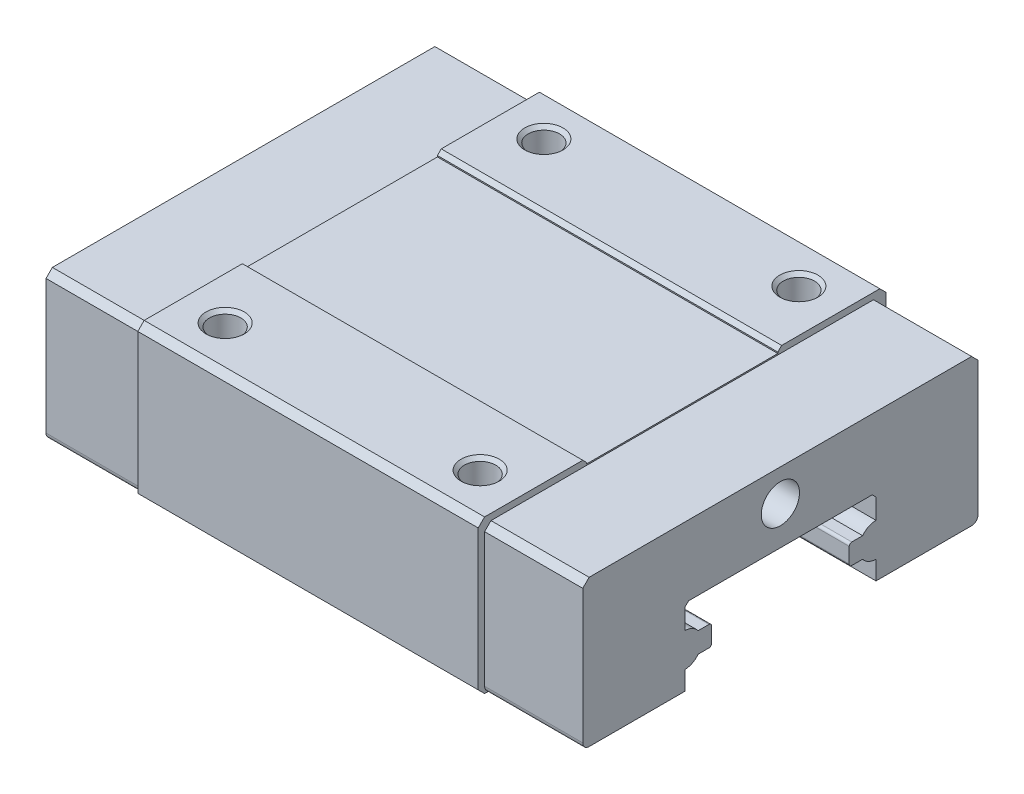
ISO-10303-21;
HEADER;
FILE_DESCRIPTION(('STEP AP214'),'2;1');
FILE_NAME('part.step','',(''),(''),'','','');
FILE_SCHEMA(('AUTOMOTIVE_DESIGN { 1 0 10303 214 1 1 1 1 }'));
ENDSEC;
DATA;
#1=APPLICATION_CONTEXT('core data for automotive mechanical design processes');
#2=APPLICATION_PROTOCOL_DEFINITION('international standard','automotive_design',2000,#1);
#3=PRODUCT_CONTEXT('',#1,'mechanical');
#4=PRODUCT('Part','Part','',(#3));
#5=PRODUCT_RELATED_PRODUCT_CATEGORY('part','',(#4));
#6=PRODUCT_DEFINITION_FORMATION('','',#4);
#7=PRODUCT_DEFINITION_CONTEXT('part definition',#1,'design');
#8=PRODUCT_DEFINITION('design','',#6,#7);
#9=PRODUCT_DEFINITION_SHAPE('','',#8);
#10=(LENGTH_UNIT() NAMED_UNIT(*) SI_UNIT(.MILLI.,.METRE.));
#11=(NAMED_UNIT(*) PLANE_ANGLE_UNIT() SI_UNIT($,.RADIAN.));
#12=(NAMED_UNIT(*) SI_UNIT($,.STERADIAN.) SOLID_ANGLE_UNIT());
#13=UNCERTAINTY_MEASURE_WITH_UNIT(LENGTH_MEASURE(1.E-05),#10,'distance_accuracy_value','');
#14=(GEOMETRIC_REPRESENTATION_CONTEXT(3) GLOBAL_UNCERTAINTY_ASSIGNED_CONTEXT((#13)) GLOBAL_UNIT_ASSIGNED_CONTEXT((#10,
#11,#12)) REPRESENTATION_CONTEXT('',''));
#15=CARTESIAN_POINT('',(0.,0.,0.));
#16=DIRECTION('',(0.,0.,1.));
#17=DIRECTION('',(1.,0.,0.));
#18=AXIS2_PLACEMENT_3D('',#15,#16,#17);
#19=CARTESIAN_POINT('',(11.05,12.,12.5));
#20=DIRECTION('',(0.,1.,0.));
#21=DIRECTION('',(0.,0.,1.));
#22=AXIS2_PLACEMENT_3D('',#19,#20,#21);
#23=CONICAL_SURFACE('',#22,1.5,0.7853981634);
#24=CARTESIAN_POINT('',(11.05,12.,12.5));
#25=DIRECTION('',(0.,-1.,0.));
#26=DIRECTION('',(0.,0.,-1.));
#27=AXIS2_PLACEMENT_3D('',#24,#25,#26);
#28=CIRCLE('',#27,1.5);
#29=CARTESIAN_POINT('',(11.05,12.,11.));
#30=VERTEX_POINT('',#29);
#31=EDGE_CURVE('E39',#30,#30,#28,.T.);
#32=ORIENTED_EDGE('',*,*,#31,.F.);
#33=EDGE_LOOP('',(#32));
#34=FACE_BOUND('',#33,.T.);
#35=CARTESIAN_POINT('',(11.05,11.7295,12.5));
#36=DIRECTION('',(0.,-1.,0.));
#37=DIRECTION('',(0.,0.,-1.));
#38=AXIS2_PLACEMENT_3D('',#35,#36,#37);
#39=CIRCLE('',#38,1.2295);
#40=CARTESIAN_POINT('',(11.05,11.7295,11.2705));
#41=VERTEX_POINT('',#40);
#42=EDGE_CURVE('E10',#41,#41,#39,.T.);
#43=ORIENTED_EDGE('',*,*,#42,.T.);
#44=EDGE_LOOP('',(#43));
#45=FACE_BOUND('',#44,.T.);
#46=ADVANCED_FACE('F16',(#34,#45),#23,.F.);
#47=CARTESIAN_POINT('',(11.05,8.,12.5));
#48=DIRECTION('',(0.,1.,0.));
#49=DIRECTION('',(0.,0.,-1.));
#50=AXIS2_PLACEMENT_3D('',#47,#48,#49);
#51=CYLINDRICAL_SURFACE('',#50,1.2295);
#52=ORIENTED_EDGE('',*,*,#42,.F.);
#53=EDGE_LOOP('',(#52));
#54=FACE_BOUND('',#53,.T.);
#55=CARTESIAN_POINT('',(11.05,8.,12.5));
#56=DIRECTION('',(0.,-1.,0.));
#57=DIRECTION('',(0.,0.,-1.));
#58=AXIS2_PLACEMENT_3D('',#55,#56,#57);
#59=CIRCLE('',#58,1.2295);
#60=CARTESIAN_POINT('',(11.05,8.,11.2705));
#61=VERTEX_POINT('',#60);
#62=EDGE_CURVE('E27',#61,#61,#59,.T.);
#63=ORIENTED_EDGE('',*,*,#62,.T.);
#64=EDGE_LOOP('',(#63));
#65=FACE_BOUND('',#64,.T.);
#66=ADVANCED_FACE('F1026',(#54,#65),#51,.F.);
#67=CARTESIAN_POINT('',(76.5,11.,15.5));
#68=DIRECTION('',(0.,0.,-1.));
#69=DIRECTION('',(0.,-1.,0.));
#70=AXIS2_PLACEMENT_3D('',#67,#68,#69);
#71=PLANE('',#70);
#72=DIRECTION('',(0.,1.,0.));
#73=VECTOR('',#72,1.);
#74=CARTESIAN_POINT('',(42.1,2.8,15.5));
#75=LINE('',#74,#73);
#76=CARTESIAN_POINT('',(42.1,0.5,15.5));
#77=VERTEX_POINT('',#76);
#78=CARTESIAN_POINT('',(42.1,11.,15.5));
#79=VERTEX_POINT('',#78);
#80=EDGE_CURVE('E528',#77,#79,#75,.T.);
#81=ORIENTED_EDGE('',*,*,#80,.T.);
#82=DIRECTION('',(-1.,0.,0.));
#83=VECTOR('',#82,1.);
#84=CARTESIAN_POINT('',(76.5,11.,15.5));
#85=LINE('',#84,#83);
#86=CARTESIAN_POINT('',(34.4,11.,15.5));
#87=VERTEX_POINT('',#86);
#88=EDGE_CURVE('E546',#79,#87,#85,.T.);
#89=ORIENTED_EDGE('',*,*,#88,.T.);
#90=DIRECTION('',(0.,-1.,0.));
#91=VECTOR('',#90,1.);
#92=CARTESIAN_POINT('',(34.4,11.,15.5));
#93=LINE('',#92,#91);
#94=CARTESIAN_POINT('',(34.4,0.5,15.5));
#95=VERTEX_POINT('',#94);
#96=EDGE_CURVE('E530',#87,#95,#93,.T.);
#97=ORIENTED_EDGE('',*,*,#96,.T.);
#98=DIRECTION('',(-1.,0.,0.));
#99=VECTOR('',#98,1.);
#100=CARTESIAN_POINT('',(76.5,0.5,15.5));
#101=LINE('',#100,#99);
#102=EDGE_CURVE('E524',#77,#95,#101,.T.);
#103=ORIENTED_EDGE('',*,*,#102,.F.);
#104=EDGE_LOOP('',(#81,#89,#97,#103));
#105=FACE_BOUND('',#104,.T.);
#106=ADVANCED_FACE('F526',(#105),#71,.F.);
#107=CARTESIAN_POINT('',(42.1,12.,-15.5));
#108=DIRECTION('',(0.,-1.,0.));
#109=DIRECTION('',(0.,0.,-1.));
#110=AXIS2_PLACEMENT_3D('',#107,#108,#109);
#111=PLANE('',#110);
#112=DIRECTION('',(-1.,0.,0.));
#113=VECTOR('',#112,1.);
#114=CARTESIAN_POINT('',(42.1,12.,7.8));
#115=LINE('',#114,#113);
#116=CARTESIAN_POINT('',(34.4,12.,7.8));
#117=VERTEX_POINT('',#116);
#118=CARTESIAN_POINT('',(7.7,12.,7.8));
#119=VERTEX_POINT('',#118);
#120=EDGE_CURVE('E858',#117,#119,#115,.T.);
#121=ORIENTED_EDGE('',*,*,#120,.T.);
#122=DIRECTION('',(0.,0.,1.));
#123=VECTOR('',#122,1.);
#124=CARTESIAN_POINT('',(7.7,12.,-16.));
#125=LINE('',#124,#123);
#126=CARTESIAN_POINT('',(7.7,12.,15.5));
#127=VERTEX_POINT('',#126);
#128=EDGE_CURVE('E854',#119,#127,#125,.T.);
#129=ORIENTED_EDGE('',*,*,#128,.T.);
#130=DIRECTION('',(-1.,0.,0.));
#131=VECTOR('',#130,1.);
#132=CARTESIAN_POINT('',(42.1,12.,15.5));
#133=LINE('',#132,#131);
#134=CARTESIAN_POINT('',(34.4,12.,15.5));
#135=VERTEX_POINT('',#134);
#136=EDGE_CURVE('E837',#135,#127,#133,.T.);
#137=ORIENTED_EDGE('',*,*,#136,.F.);
#138=DIRECTION('',(0.,0.,1.));
#139=VECTOR('',#138,1.);
#140=CARTESIAN_POINT('',(34.4,12.,-16.));
#141=LINE('',#140,#139);
#142=EDGE_CURVE('E621',#117,#135,#141,.T.);
#143=ORIENTED_EDGE('',*,*,#142,.F.);
#144=EDGE_LOOP('',(#121,#129,#137,#143));
#145=FACE_BOUND('',#144,.T.);
#146=ORIENTED_EDGE('',*,*,#31,.T.);
#147=EDGE_LOOP('',(#146));
#148=FACE_BOUND('',#147,.T.);
#149=CARTESIAN_POINT('',(31.05,12.,12.5));
#150=DIRECTION('',(0.,-1.,0.));
#151=DIRECTION('',(0.,0.,-1.));
#152=AXIS2_PLACEMENT_3D('',#149,#150,#151);
#153=CIRCLE('',#152,1.5);
#154=CARTESIAN_POINT('',(31.05,12.,11.));
#155=VERTEX_POINT('',#154);
#156=EDGE_CURVE('E888',#155,#155,#153,.T.);
#157=ORIENTED_EDGE('',*,*,#156,.T.);
#158=EDGE_LOOP('',(#157));
#159=FACE_BOUND('',#158,.T.);
#160=ADVANCED_FACE('F1045',(#145,#148,#159),#111,.F.);
#161=CARTESIAN_POINT('',(42.1,12.,-15.5));
#162=DIRECTION('',(0.,-1.,0.));
#163=DIRECTION('',(0.,0.,-1.));
#164=AXIS2_PLACEMENT_3D('',#161,#162,#163);
#165=PLANE('',#164);
#166=DIRECTION('',(-1.,0.,0.));
#167=VECTOR('',#166,1.);
#168=CARTESIAN_POINT('',(42.1,12.,-7.8));
#169=LINE('',#168,#167);
#170=CARTESIAN_POINT('',(34.4,12.,-7.8));
#171=VERTEX_POINT('',#170);
#172=CARTESIAN_POINT('',(7.7,12.,-7.8));
#173=VERTEX_POINT('',#172);
#174=EDGE_CURVE('E1226',#171,#173,#169,.T.);
#175=ORIENTED_EDGE('',*,*,#174,.F.);
#176=DIRECTION('',(0.,0.,1.));
#177=VECTOR('',#176,1.);
#178=CARTESIAN_POINT('',(34.4,12.,-16.));
#179=LINE('',#178,#177);
#180=CARTESIAN_POINT('',(34.4,12.,-15.5));
#181=VERTEX_POINT('',#180);
#182=EDGE_CURVE('E630',#181,#171,#179,.T.);
#183=ORIENTED_EDGE('',*,*,#182,.F.);
#184=DIRECTION('',(-1.,0.,0.));
#185=VECTOR('',#184,1.);
#186=CARTESIAN_POINT('',(42.1,12.,-15.5));
#187=LINE('',#186,#185);
#188=CARTESIAN_POINT('',(7.7,12.,-15.5));
#189=VERTEX_POINT('',#188);
#190=EDGE_CURVE('E738',#181,#189,#187,.T.);
#191=ORIENTED_EDGE('',*,*,#190,.T.);
#192=DIRECTION('',(0.,0.,1.));
#193=VECTOR('',#192,1.);
#194=CARTESIAN_POINT('',(7.7,12.,-16.));
#195=LINE('',#194,#193);
#196=EDGE_CURVE('E734',#189,#173,#195,.T.);
#197=ORIENTED_EDGE('',*,*,#196,.T.);
#198=EDGE_LOOP('',(#175,#183,#191,#197));
#199=FACE_BOUND('',#198,.T.);
#200=CARTESIAN_POINT('',(11.05,12.,-12.5));
#201=DIRECTION('',(0.,-1.,0.));
#202=DIRECTION('',(0.,0.,-1.));
#203=AXIS2_PLACEMENT_3D('',#200,#201,#202);
#204=CIRCLE('',#203,1.5);
#205=CARTESIAN_POINT('',(11.05,12.,-14.));
#206=VERTEX_POINT('',#205);
#207=EDGE_CURVE('E739',#206,#206,#204,.T.);
#208=ORIENTED_EDGE('',*,*,#207,.T.);
#209=EDGE_LOOP('',(#208));
#210=FACE_BOUND('',#209,.T.);
#211=CARTESIAN_POINT('',(31.05,12.,-12.5));
#212=DIRECTION('',(0.,-1.,0.));
#213=DIRECTION('',(0.,0.,-1.));
#214=AXIS2_PLACEMENT_3D('',#211,#212,#213);
#215=CIRCLE('',#214,1.5);
#216=CARTESIAN_POINT('',(31.05,12.,-14.));
#217=VERTEX_POINT('',#216);
#218=EDGE_CURVE('E733',#217,#217,#215,.T.);
#219=ORIENTED_EDGE('',*,*,#218,.T.);
#220=EDGE_LOOP('',(#219));
#221=FACE_BOUND('',#220,.T.);
#222=ADVANCED_FACE('F1048',(#199,#210,#221),#165,.F.);
#223=CARTESIAN_POINT('',(42.1,11.5,-16.));
#224=DIRECTION('',(0.,-0.707106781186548,0.707106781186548));
#225=DIRECTION('',(-1.,0.,0.));
#226=AXIS2_PLACEMENT_3D('',#223,#224,#225);
#227=PLANE('',#226);
#228=DIRECTION('',(0.,0.707106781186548,0.707106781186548));
#229=VECTOR('',#228,1.);
#230=CARTESIAN_POINT('',(34.4,11.5,-16.));
#231=LINE('',#230,#229);
#232=CARTESIAN_POINT('',(34.4,11.5,-16.));
#233=VERTEX_POINT('',#232);
#234=EDGE_CURVE('E870',#233,#181,#231,.T.);
#235=ORIENTED_EDGE('',*,*,#234,.F.);
#236=DIRECTION('',(-1.,0.,0.));
#237=VECTOR('',#236,1.);
#238=CARTESIAN_POINT('',(42.1,11.5,-16.));
#239=LINE('',#238,#237);
#240=CARTESIAN_POINT('',(7.7,11.5,-16.));
#241=VERTEX_POINT('',#240);
#242=EDGE_CURVE('E704',#233,#241,#239,.T.);
#243=ORIENTED_EDGE('',*,*,#242,.T.);
#244=DIRECTION('',(0.,0.707106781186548,0.707106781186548));
#245=VECTOR('',#244,1.);
#246=CARTESIAN_POINT('',(7.7,11.5,-16.));
#247=LINE('',#246,#245);
#248=EDGE_CURVE('E700',#241,#189,#247,.T.);
#249=ORIENTED_EDGE('',*,*,#248,.T.);
#250=ORIENTED_EDGE('',*,*,#190,.F.);
#251=EDGE_LOOP('',(#235,#243,#249,#250));
#252=FACE_BOUND('',#251,.T.);
#253=ADVANCED_FACE('F1087',(#252),#227,.F.);
#254=CARTESIAN_POINT('',(42.1,0.5,-16.));
#255=DIRECTION('',(0.,0.,1.));
#256=DIRECTION('',(1.,0.,0.));
#257=AXIS2_PLACEMENT_3D('',#254,#255,#256);
#258=PLANE('',#257);
#259=DIRECTION('',(0.,1.,0.));
#260=VECTOR('',#259,1.);
#261=CARTESIAN_POINT('',(34.4,-1.,-16.));
#262=LINE('',#261,#260);
#263=CARTESIAN_POINT('',(34.4,0.5,-16.));
#264=VERTEX_POINT('',#263);
#265=EDGE_CURVE('E585',#264,#233,#262,.T.);
#266=ORIENTED_EDGE('',*,*,#265,.F.);
#267=DIRECTION('',(-1.,0.,0.));
#268=VECTOR('',#267,1.);
#269=CARTESIAN_POINT('',(42.1,0.5,-16.));
#270=LINE('',#269,#268);
#271=CARTESIAN_POINT('',(7.7,0.5,-16.));
#272=VERTEX_POINT('',#271);
#273=EDGE_CURVE('E705',#264,#272,#270,.T.);
#274=ORIENTED_EDGE('',*,*,#273,.T.);
#275=DIRECTION('',(0.,1.,0.));
#276=VECTOR('',#275,1.);
#277=CARTESIAN_POINT('',(7.7,-1.,-16.));
#278=LINE('',#277,#276);
#279=EDGE_CURVE('E728',#272,#241,#278,.T.);
#280=ORIENTED_EDGE('',*,*,#279,.T.);
#281=ORIENTED_EDGE('',*,*,#242,.F.);
#282=EDGE_LOOP('',(#266,#274,#280,#281));
#283=FACE_BOUND('',#282,.T.);
#284=ADVANCED_FACE('F1065',(#283),#258,.F.);
#285=CARTESIAN_POINT('',(42.1,0.,-15.5));
#286=DIRECTION('',(0.,0.707106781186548,0.707106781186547));
#287=DIRECTION('',(1.,0.,0.));
#288=AXIS2_PLACEMENT_3D('',#285,#286,#287);
#289=PLANE('',#288);
#290=DIRECTION('',(0.,0.707106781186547,-0.707106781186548));
#291=VECTOR('',#290,1.);
#292=CARTESIAN_POINT('',(34.4,0.,-15.5));
#293=LINE('',#292,#291);
#294=CARTESIAN_POINT('',(34.4,0.,-15.5));
#295=VERTEX_POINT('',#294);
#296=EDGE_CURVE('E580',#295,#264,#293,.T.);
#297=ORIENTED_EDGE('',*,*,#296,.F.);
#298=DIRECTION('',(-1.,0.,0.));
#299=VECTOR('',#298,1.);
#300=CARTESIAN_POINT('',(42.1,0.,-15.5));
#301=LINE('',#300,#299);
#302=CARTESIAN_POINT('',(7.7,0.,-15.5));
#303=VERTEX_POINT('',#302);
#304=EDGE_CURVE('E724',#295,#303,#301,.T.);
#305=ORIENTED_EDGE('',*,*,#304,.T.);
#306=DIRECTION('',(0.,0.707106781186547,-0.707106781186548));
#307=VECTOR('',#306,1.);
#308=CARTESIAN_POINT('',(7.7,0.,-15.5));
#309=LINE('',#308,#307);
#310=EDGE_CURVE('E729',#303,#272,#309,.T.);
#311=ORIENTED_EDGE('',*,*,#310,.T.);
#312=ORIENTED_EDGE('',*,*,#273,.F.);
#313=EDGE_LOOP('',(#297,#305,#311,#312));
#314=FACE_BOUND('',#313,.T.);
#315=ADVANCED_FACE('F1061',(#314),#289,.F.);
#316=CARTESIAN_POINT('',(42.1,0.,-7.5));
#317=DIRECTION('',(0.,1.,0.));
#318=DIRECTION('',(1.,0.,0.));
#319=AXIS2_PLACEMENT_3D('',#316,#317,#318);
#320=PLANE('',#319);
#321=DIRECTION('',(-1.,0.,0.));
#322=VECTOR('',#321,1.);
#323=CARTESIAN_POINT('',(42.1,0.,-7.5));
#324=LINE('',#323,#322);
#325=CARTESIAN_POINT('',(42.1,0.,-7.5));
#326=VERTEX_POINT('',#325);
#327=CARTESIAN_POINT('',(0.,0.,-7.5));
#328=VERTEX_POINT('',#327);
#329=EDGE_CURVE('E747',#326,#328,#324,.T.);
#330=ORIENTED_EDGE('',*,*,#329,.T.);
#331=DIRECTION('',(0.,0.,-1.));
#332=VECTOR('',#331,1.);
#333=CARTESIAN_POINT('',(0.,0.,-7.5));
#334=LINE('',#333,#332);
#335=CARTESIAN_POINT('',(0.,0.,-15.));
#336=VERTEX_POINT('',#335);
#337=EDGE_CURVE('E786',#328,#336,#334,.T.);
#338=ORIENTED_EDGE('',*,*,#337,.T.);
#339=DIRECTION('',(1.,0.,0.));
#340=VECTOR('',#339,1.);
#341=CARTESIAN_POINT('',(-34.4,0.,-15.));
#342=LINE('',#341,#340);
#343=CARTESIAN_POINT('',(7.7,0.,-15.));
#344=VERTEX_POINT('',#343);
#345=EDGE_CURVE('E818',#336,#344,#342,.T.);
#346=ORIENTED_EDGE('',*,*,#345,.T.);
#347=DIRECTION('',(0.,0.,-1.));
#348=VECTOR('',#347,1.);
#349=CARTESIAN_POINT('',(7.7,0.,-7.5));
#350=LINE('',#349,#348);
#351=EDGE_CURVE('E822',#344,#303,#350,.T.);
#352=ORIENTED_EDGE('',*,*,#351,.T.);
#353=ORIENTED_EDGE('',*,*,#304,.F.);
#354=DIRECTION('',(0.,0.,-1.));
#355=VECTOR('',#354,1.);
#356=CARTESIAN_POINT('',(34.4,0.,-7.5));
#357=LINE('',#356,#355);
#358=CARTESIAN_POINT('',(34.4,0.,-15.));
#359=VERTEX_POINT('',#358);
#360=EDGE_CURVE('E584',#359,#295,#357,.T.);
#361=ORIENTED_EDGE('',*,*,#360,.F.);
#362=DIRECTION('',(-1.,0.,0.));
#363=VECTOR('',#362,1.);
#364=CARTESIAN_POINT('',(76.5,0.,-15.));
#365=LINE('',#364,#363);
#366=CARTESIAN_POINT('',(42.1,0.,-15.));
#367=VERTEX_POINT('',#366);
#368=EDGE_CURVE('E620',#367,#359,#365,.T.);
#369=ORIENTED_EDGE('',*,*,#368,.F.);
#370=DIRECTION('',(0.,0.,-1.));
#371=VECTOR('',#370,1.);
#372=CARTESIAN_POINT('',(42.1,0.,-7.5));
#373=LINE('',#372,#371);
#374=EDGE_CURVE('E614',#326,#367,#373,.T.);
#375=ORIENTED_EDGE('',*,*,#374,.F.);
#376=EDGE_LOOP('',(#330,#338,#346,#352,#353,#361,#369,#375));
#377=FACE_BOUND('',#376,.T.);
#378=ADVANCED_FACE('F1064',(#377),#320,.F.);
#379=CARTESIAN_POINT('',(42.1,1.47996212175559,-7.5));
#380=DIRECTION('',(0.,0.,-1.));
#381=DIRECTION('',(0.,-1.,0.));
#382=AXIS2_PLACEMENT_3D('',#379,#380,#381);
#383=PLANE('',#382);
#384=DIRECTION('',(0.,-1.,0.));
#385=VECTOR('',#384,1.);
#386=CARTESIAN_POINT('',(0.,1.47996212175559,-7.5));
#387=LINE('',#386,#385);
#388=CARTESIAN_POINT('',(0.,1.47996212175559,-7.5));
#389=VERTEX_POINT('',#388);
#390=EDGE_CURVE('E881',#389,#328,#387,.T.);
#391=ORIENTED_EDGE('',*,*,#390,.T.);
#392=ORIENTED_EDGE('',*,*,#329,.F.);
#393=DIRECTION('',(0.,-1.,0.));
#394=VECTOR('',#393,1.);
#395=CARTESIAN_POINT('',(42.1,1.47996212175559,-7.5));
#396=LINE('',#395,#394);
#397=CARTESIAN_POINT('',(42.1,1.47996212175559,-7.5));
#398=VERTEX_POINT('',#397);
#399=EDGE_CURVE('E631',#398,#326,#396,.T.);
#400=ORIENTED_EDGE('',*,*,#399,.F.);
#401=DIRECTION('',(-1.,0.,0.));
#402=VECTOR('',#401,1.);
#403=CARTESIAN_POINT('',(42.1,1.47996212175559,-7.5));
#404=LINE('',#403,#402);
#405=EDGE_CURVE('E1793',#398,#389,#404,.T.);
#406=ORIENTED_EDGE('',*,*,#405,.T.);
#407=EDGE_LOOP('',(#391,#392,#400,#406));
#408=FACE_BOUND('',#407,.T.);
#409=ADVANCED_FACE('F1141',(#408),#383,.F.);
#410=CARTESIAN_POINT('',(42.1,2.8,-7.5));
#411=DIRECTION('',(1.,0.,0.));
#412=DIRECTION('',(0.,0.,1.));
#413=AXIS2_PLACEMENT_3D('',#410,#411,#412);
#414=CYLINDRICAL_SURFACE('',#413,1.3200378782);
#415=CARTESIAN_POINT('',(0.,2.8,-7.5));
#416=DIRECTION('',(1.,0.,0.));
#417=DIRECTION('',(0.,0.,-1.));
#418=AXIS2_PLACEMENT_3D('',#415,#416,#417);
#419=CIRCLE('',#418,1.3200378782);
#420=CARTESIAN_POINT('',(0.,2.,-6.45));
#421=VERTEX_POINT('',#420);
#422=EDGE_CURVE('E877',#421,#389,#419,.T.);
#423=ORIENTED_EDGE('',*,*,#422,.T.);
#424=ORIENTED_EDGE('',*,*,#405,.F.);
#425=CARTESIAN_POINT('',(42.1,2.8,-7.5));
#426=DIRECTION('',(1.,0.,0.));
#427=DIRECTION('',(0.,0.,-1.));
#428=AXIS2_PLACEMENT_3D('',#425,#426,#427);
#429=CIRCLE('',#428,1.3200378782);
#430=CARTESIAN_POINT('',(42.1,2.,-6.45));
#431=VERTEX_POINT('',#430);
#432=EDGE_CURVE('E635',#431,#398,#429,.T.);
#433=ORIENTED_EDGE('',*,*,#432,.F.);
#434=DIRECTION('',(-1.,0.,0.));
#435=VECTOR('',#434,1.);
#436=CARTESIAN_POINT('',(42.1,2.,-6.45));
#437=LINE('',#436,#435);
#438=EDGE_CURVE('E874',#431,#421,#437,.T.);
#439=ORIENTED_EDGE('',*,*,#438,.T.);
#440=EDGE_LOOP('',(#423,#424,#433,#439));
#441=FACE_BOUND('',#440,.T.);
#442=ADVANCED_FACE('F1131',(#441),#414,.T.);
#443=CARTESIAN_POINT('',(42.1,2.,-5.6));
#444=DIRECTION('',(0.,1.,0.));
#445=DIRECTION('',(1.,0.,0.));
#446=AXIS2_PLACEMENT_3D('',#443,#444,#445);
#447=PLANE('',#446);
#448=DIRECTION('',(0.,0.,-1.));
#449=VECTOR('',#448,1.);
#450=CARTESIAN_POINT('',(0.,2.,-5.6));
#451=LINE('',#450,#449);
#452=CARTESIAN_POINT('',(0.,2.,-5.6));
#453=VERTEX_POINT('',#452);
#454=EDGE_CURVE('E743',#453,#421,#451,.T.);
#455=ORIENTED_EDGE('',*,*,#454,.T.);
#456=ORIENTED_EDGE('',*,*,#438,.F.);
#457=DIRECTION('',(0.,0.,-1.));
#458=VECTOR('',#457,1.);
#459=CARTESIAN_POINT('',(42.1,2.,-5.6));
#460=LINE('',#459,#458);
#461=CARTESIAN_POINT('',(42.1,2.,-5.6));
#462=VERTEX_POINT('',#461);
#463=EDGE_CURVE('E927',#462,#431,#460,.T.);
#464=ORIENTED_EDGE('',*,*,#463,.F.);
#465=DIRECTION('',(-1.,0.,0.));
#466=VECTOR('',#465,1.);
#467=CARTESIAN_POINT('',(42.1,2.,-5.6));
#468=LINE('',#467,#466);
#469=EDGE_CURVE('E740',#462,#453,#468,.T.);
#470=ORIENTED_EDGE('',*,*,#469,.T.);
#471=EDGE_LOOP('',(#455,#456,#464,#470));
#472=FACE_BOUND('',#471,.T.);
#473=ADVANCED_FACE('F1059',(#472),#447,.F.);
#474=CARTESIAN_POINT('',(42.1,2.2,-5.6));
#475=DIRECTION('',(1.,0.,0.));
#476=DIRECTION('',(0.,0.,1.));
#477=AXIS2_PLACEMENT_3D('',#474,#475,#476);
#478=CYLINDRICAL_SURFACE('',#477,0.2);
#479=CARTESIAN_POINT('',(0.,2.2,-5.6));
#480=DIRECTION('',(1.,0.,0.));
#481=DIRECTION('',(0.,0.,-1.));
#482=AXIS2_PLACEMENT_3D('',#479,#480,#481);
#483=CIRCLE('',#482,0.2);
#484=CARTESIAN_POINT('',(0.,2.2,-5.4));
#485=VERTEX_POINT('',#484);
#486=EDGE_CURVE('E605',#485,#453,#483,.T.);
#487=ORIENTED_EDGE('',*,*,#486,.T.);
#488=ORIENTED_EDGE('',*,*,#469,.F.);
#489=CARTESIAN_POINT('',(42.1,2.2,-5.6));
#490=DIRECTION('',(1.,0.,0.));
#491=DIRECTION('',(0.,0.,-1.));
#492=AXIS2_PLACEMENT_3D('',#489,#490,#491);
#493=CIRCLE('',#492,0.2);
#494=CARTESIAN_POINT('',(42.1,2.2,-5.4));
#495=VERTEX_POINT('',#494);
#496=EDGE_CURVE('E922',#495,#462,#493,.T.);
#497=ORIENTED_EDGE('',*,*,#496,.F.);
#498=DIRECTION('',(-1.,0.,0.));
#499=VECTOR('',#498,1.);
#500=CARTESIAN_POINT('',(42.1,2.2,-5.4));
#501=LINE('',#500,#499);
#502=EDGE_CURVE('E602',#495,#485,#501,.T.);
#503=ORIENTED_EDGE('',*,*,#502,.T.);
#504=EDGE_LOOP('',(#487,#488,#497,#503));
#505=FACE_BOUND('',#504,.T.);
#506=ADVANCED_FACE('F1056',(#505),#478,.T.);
#507=CARTESIAN_POINT('',(42.1,3.4,-5.4));
#508=DIRECTION('',(0.,0.,-1.));
#509=DIRECTION('',(0.,-1.,0.));
#510=AXIS2_PLACEMENT_3D('',#507,#508,#509);
#511=PLANE('',#510);
#512=DIRECTION('',(0.,-1.,0.));
#513=VECTOR('',#512,1.);
#514=CARTESIAN_POINT('',(0.,3.4,-5.4));
#515=LINE('',#514,#513);
#516=CARTESIAN_POINT('',(0.,3.4,-5.4));
#517=VERTEX_POINT('',#516);
#518=EDGE_CURVE('E606',#517,#485,#515,.T.);
#519=ORIENTED_EDGE('',*,*,#518,.T.);
#520=ORIENTED_EDGE('',*,*,#502,.F.);
#521=DIRECTION('',(0.,-1.,0.));
#522=VECTOR('',#521,1.);
#523=CARTESIAN_POINT('',(42.1,3.4,-5.4));
#524=LINE('',#523,#522);
#525=CARTESIAN_POINT('',(42.1,3.4,-5.4));
#526=VERTEX_POINT('',#525);
#527=EDGE_CURVE('E926',#526,#495,#524,.T.);
#528=ORIENTED_EDGE('',*,*,#527,.F.);
#529=DIRECTION('',(-1.,0.,0.));
#530=VECTOR('',#529,1.);
#531=CARTESIAN_POINT('',(42.1,3.4,-5.4));
#532=LINE('',#531,#530);
#533=EDGE_CURVE('E832',#526,#517,#532,.T.);
#534=ORIENTED_EDGE('',*,*,#533,.T.);
#535=EDGE_LOOP('',(#519,#520,#528,#534));
#536=FACE_BOUND('',#535,.T.);
#537=ADVANCED_FACE('F1043',(#536),#511,.F.);
#538=CARTESIAN_POINT('',(42.1,3.4,-5.6));
#539=DIRECTION('',(1.,0.,0.));
#540=DIRECTION('',(0.,0.,1.));
#541=AXIS2_PLACEMENT_3D('',#538,#539,#540);
#542=CYLINDRICAL_SURFACE('',#541,0.2);
#543=CARTESIAN_POINT('',(0.,3.4,-5.6));
#544=DIRECTION('',(1.,0.,0.));
#545=DIRECTION('',(0.,0.,-1.));
#546=AXIS2_PLACEMENT_3D('',#543,#544,#545);
#547=CIRCLE('',#546,0.2);
#548=CARTESIAN_POINT('',(0.,3.6,-5.6));
#549=VERTEX_POINT('',#548);
#550=EDGE_CURVE('E892',#549,#517,#547,.T.);
#551=ORIENTED_EDGE('',*,*,#550,.T.);
#552=ORIENTED_EDGE('',*,*,#533,.F.);
#553=CARTESIAN_POINT('',(42.1,3.4,-5.6));
#554=DIRECTION('',(1.,0.,0.));
#555=DIRECTION('',(0.,0.,-1.));
#556=AXIS2_PLACEMENT_3D('',#553,#554,#555);
#557=CIRCLE('',#556,0.2);
#558=CARTESIAN_POINT('',(42.1,3.6,-5.6));
#559=VERTEX_POINT('',#558);
#560=EDGE_CURVE('E1816',#559,#526,#557,.T.);
#561=ORIENTED_EDGE('',*,*,#560,.F.);
#562=DIRECTION('',(-1.,0.,0.));
#563=VECTOR('',#562,1.);
#564=CARTESIAN_POINT('',(42.1,3.6,-5.6));
#565=LINE('',#564,#563);
#566=EDGE_CURVE('E595',#559,#549,#565,.T.);
#567=ORIENTED_EDGE('',*,*,#566,.T.);
#568=EDGE_LOOP('',(#551,#552,#561,#567));
#569=FACE_BOUND('',#568,.T.);
#570=ADVANCED_FACE('F1039',(#569),#542,.T.);
#571=CARTESIAN_POINT('',(42.1,3.6,-6.45));
#572=DIRECTION('',(0.,-1.,0.));
#573=DIRECTION('',(0.,0.,-1.));
#574=AXIS2_PLACEMENT_3D('',#571,#572,#573);
#575=PLANE('',#574);
#576=DIRECTION('',(0.,0.,1.));
#577=VECTOR('',#576,1.);
#578=CARTESIAN_POINT('',(0.,3.6,-6.45));
#579=LINE('',#578,#577);
#580=CARTESIAN_POINT('',(0.,3.6,-6.45));
#581=VERTEX_POINT('',#580);
#582=EDGE_CURVE('E591',#581,#549,#579,.T.);
#583=ORIENTED_EDGE('',*,*,#582,.T.);
#584=ORIENTED_EDGE('',*,*,#566,.F.);
#585=DIRECTION('',(0.,0.,1.));
#586=VECTOR('',#585,1.);
#587=CARTESIAN_POINT('',(42.1,3.6,-6.45));
#588=LINE('',#587,#586);
#589=CARTESIAN_POINT('',(42.1,3.6,-6.45));
#590=VERTEX_POINT('',#589);
#591=EDGE_CURVE('E684',#590,#559,#588,.T.);
#592=ORIENTED_EDGE('',*,*,#591,.F.);
#593=DIRECTION('',(-1.,0.,0.));
#594=VECTOR('',#593,1.);
#595=CARTESIAN_POINT('',(42.1,3.6,-6.45));
#596=LINE('',#595,#594);
#597=EDGE_CURVE('E596',#590,#581,#596,.T.);
#598=ORIENTED_EDGE('',*,*,#597,.T.);
#599=EDGE_LOOP('',(#583,#584,#592,#598));
#600=FACE_BOUND('',#599,.T.);
#601=ADVANCED_FACE('F1042',(#600),#575,.F.);
#602=CARTESIAN_POINT('',(42.1,2.8,-7.5));
#603=DIRECTION('',(1.,0.,0.));
#604=DIRECTION('',(0.,0.,1.));
#605=AXIS2_PLACEMENT_3D('',#602,#603,#604);
#606=CYLINDRICAL_SURFACE('',#605,1.3200378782);
#607=CARTESIAN_POINT('',(0.,2.8,-7.5));
#608=DIRECTION('',(1.,0.,0.));
#609=DIRECTION('',(0.,0.,-1.));
#610=AXIS2_PLACEMENT_3D('',#607,#608,#609);
#611=CIRCLE('',#610,1.3200378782);
#612=CARTESIAN_POINT('',(0.,4.12003787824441,-7.5));
#613=VERTEX_POINT('',#612);
#614=EDGE_CURVE('E940',#613,#581,#611,.T.);
#615=ORIENTED_EDGE('',*,*,#614,.T.);
#616=ORIENTED_EDGE('',*,*,#597,.F.);
#617=CARTESIAN_POINT('',(42.1,2.8,-7.5));
#618=DIRECTION('',(1.,0.,0.));
#619=DIRECTION('',(0.,0.,-1.));
#620=AXIS2_PLACEMENT_3D('',#617,#618,#619);
#621=CIRCLE('',#620,1.3200378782);
#622=CARTESIAN_POINT('',(42.1,4.12003787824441,-7.5));
#623=VERTEX_POINT('',#622);
#624=EDGE_CURVE('E679',#623,#590,#621,.T.);
#625=ORIENTED_EDGE('',*,*,#624,.F.);
#626=DIRECTION('',(-1.,0.,0.));
#627=VECTOR('',#626,1.);
#628=CARTESIAN_POINT('',(42.1,4.12003787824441,-7.5));
#629=LINE('',#628,#627);
#630=EDGE_CURVE('E677',#623,#613,#629,.T.);
#631=ORIENTED_EDGE('',*,*,#630,.T.);
#632=EDGE_LOOP('',(#615,#616,#625,#631));
#633=FACE_BOUND('',#632,.T.);
#634=ADVANCED_FACE('F1150',(#633),#606,.T.);
#635=CARTESIAN_POINT('',(42.1,5.7,-7.5));
#636=DIRECTION('',(0.,0.,-1.));
#637=DIRECTION('',(0.,-1.,0.));
#638=AXIS2_PLACEMENT_3D('',#635,#636,#637);
#639=PLANE('',#638);
#640=DIRECTION('',(0.,-1.,0.));
#641=VECTOR('',#640,1.);
#642=CARTESIAN_POINT('',(0.,5.7,-7.5));
#643=LINE('',#642,#641);
#644=CARTESIAN_POINT('',(0.,5.7,-7.5));
#645=VERTEX_POINT('',#644);
#646=EDGE_CURVE('E673',#645,#613,#643,.T.);
#647=ORIENTED_EDGE('',*,*,#646,.T.);
#648=ORIENTED_EDGE('',*,*,#630,.F.);
#649=DIRECTION('',(0.,-1.,0.));
#650=VECTOR('',#649,1.);
#651=CARTESIAN_POINT('',(42.1,5.7,-7.5));
#652=LINE('',#651,#650);
#653=CARTESIAN_POINT('',(42.1,5.7,-7.5));
#654=VERTEX_POINT('',#653);
#655=EDGE_CURVE('E683',#654,#623,#652,.T.);
#656=ORIENTED_EDGE('',*,*,#655,.F.);
#657=DIRECTION('',(-1.,0.,0.));
#658=VECTOR('',#657,1.);
#659=CARTESIAN_POINT('',(42.1,5.7,-7.5));
#660=LINE('',#659,#658);
#661=EDGE_CURVE('E678',#654,#645,#660,.T.);
#662=ORIENTED_EDGE('',*,*,#661,.T.);
#663=EDGE_LOOP('',(#647,#648,#656,#662));
#664=FACE_BOUND('',#663,.T.);
#665=ADVANCED_FACE('F1169',(#664),#639,.F.);
#666=CARTESIAN_POINT('',(42.1,6.,-7.2));
#667=DIRECTION('',(0.,0.707106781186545,-0.70710678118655));
#668=DIRECTION('',(-1.,0.,0.));
#669=AXIS2_PLACEMENT_3D('',#666,#667,#668);
#670=PLANE('',#669);
#671=DIRECTION('',(0.,-0.70710678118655,-0.707106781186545));
#672=VECTOR('',#671,1.);
#673=CARTESIAN_POINT('',(0.,6.,-7.2));
#674=LINE('',#673,#672);
#675=CARTESIAN_POINT('',(0.,6.,-7.2));
#676=VERTEX_POINT('',#675);
#677=EDGE_CURVE('E789',#676,#645,#674,.T.);
#678=ORIENTED_EDGE('',*,*,#677,.T.);
#679=ORIENTED_EDGE('',*,*,#661,.F.);
#680=DIRECTION('',(0.,-0.70710678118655,-0.707106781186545));
#681=VECTOR('',#680,1.);
#682=CARTESIAN_POINT('',(42.1,6.,-7.2));
#683=LINE('',#682,#681);
#684=CARTESIAN_POINT('',(42.1,6.,-7.2));
#685=VERTEX_POINT('',#684);
#686=EDGE_CURVE('E1824',#685,#654,#683,.T.);
#687=ORIENTED_EDGE('',*,*,#686,.F.);
#688=DIRECTION('',(-1.,0.,0.));
#689=VECTOR('',#688,1.);
#690=CARTESIAN_POINT('',(42.1,6.,-7.2));
#691=LINE('',#690,#689);
#692=EDGE_CURVE('E652',#685,#676,#691,.T.);
#693=ORIENTED_EDGE('',*,*,#692,.T.);
#694=EDGE_LOOP('',(#678,#679,#687,#693));
#695=FACE_BOUND('',#694,.T.);
#696=ADVANCED_FACE('F1172',(#695),#670,.F.);
#697=CARTESIAN_POINT('',(42.1,6.,7.2));
#698=DIRECTION('',(0.,1.,0.));
#699=DIRECTION('',(1.,0.,0.));
#700=AXIS2_PLACEMENT_3D('',#697,#698,#699);
#701=PLANE('',#700);
#702=DIRECTION('',(0.,0.,-1.));
#703=VECTOR('',#702,1.);
#704=CARTESIAN_POINT('',(0.,6.,7.2));
#705=LINE('',#704,#703);
#706=CARTESIAN_POINT('',(0.,6.,7.2));
#707=VERTEX_POINT('',#706);
#708=EDGE_CURVE('E643',#707,#676,#705,.T.);
#709=ORIENTED_EDGE('',*,*,#708,.T.);
#710=ORIENTED_EDGE('',*,*,#692,.F.);
#711=DIRECTION('',(0.,0.,-1.));
#712=VECTOR('',#711,1.);
#713=CARTESIAN_POINT('',(42.1,6.,7.2));
#714=LINE('',#713,#712);
#715=CARTESIAN_POINT('',(42.1,6.,7.2));
#716=VERTEX_POINT('',#715);
#717=EDGE_CURVE('E921',#716,#685,#714,.T.);
#718=ORIENTED_EDGE('',*,*,#717,.F.);
#719=DIRECTION('',(-1.,0.,0.));
#720=VECTOR('',#719,1.);
#721=CARTESIAN_POINT('',(42.1,6.,7.2));
#722=LINE('',#721,#720);
#723=EDGE_CURVE('E641',#716,#707,#722,.T.);
#724=ORIENTED_EDGE('',*,*,#723,.T.);
#725=EDGE_LOOP('',(#709,#710,#718,#724));
#726=FACE_BOUND('',#725,.T.);
#727=ADVANCED_FACE('F1272',(#726),#701,.F.);
#728=CARTESIAN_POINT('',(42.1,5.7,7.5));
#729=DIRECTION('',(0.,0.707106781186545,0.70710678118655));
#730=DIRECTION('',(1.,0.,0.));
#731=AXIS2_PLACEMENT_3D('',#728,#729,#730);
#732=PLANE('',#731);
#733=DIRECTION('',(0.,0.70710678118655,-0.707106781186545));
#734=VECTOR('',#733,1.);
#735=CARTESIAN_POINT('',(0.,5.7,7.5));
#736=LINE('',#735,#734);
#737=CARTESIAN_POINT('',(0.,5.7,7.5));
#738=VERTEX_POINT('',#737);
#739=EDGE_CURVE('E644',#738,#707,#736,.T.);
#740=ORIENTED_EDGE('',*,*,#739,.T.);
#741=ORIENTED_EDGE('',*,*,#723,.F.);
#742=DIRECTION('',(0.,0.70710678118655,-0.707106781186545));
#743=VECTOR('',#742,1.);
#744=CARTESIAN_POINT('',(42.1,5.7,7.5));
#745=LINE('',#744,#743);
#746=CARTESIAN_POINT('',(42.1,5.7,7.5));
#747=VERTEX_POINT('',#746);
#748=EDGE_CURVE('E916',#747,#716,#745,.T.);
#749=ORIENTED_EDGE('',*,*,#748,.F.);
#750=DIRECTION('',(-1.,0.,0.));
#751=VECTOR('',#750,1.);
#752=CARTESIAN_POINT('',(42.1,5.7,7.5));
#753=LINE('',#752,#751);
#754=EDGE_CURVE('E656',#747,#738,#753,.T.);
#755=ORIENTED_EDGE('',*,*,#754,.T.);
#756=EDGE_LOOP('',(#740,#741,#749,#755));
#757=FACE_BOUND('',#756,.T.);
#758=ADVANCED_FACE('F1037',(#757),#732,.F.);
#759=CARTESIAN_POINT('',(42.1,4.12003787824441,7.5));
#760=DIRECTION('',(0.,0.,1.));
#761=DIRECTION('',(1.,0.,0.));
#762=AXIS2_PLACEMENT_3D('',#759,#760,#761);
#763=PLANE('',#762);
#764=DIRECTION('',(0.,1.,0.));
#765=VECTOR('',#764,1.);
#766=CARTESIAN_POINT('',(0.,4.12003787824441,7.5));
#767=LINE('',#766,#765);
#768=CARTESIAN_POINT('',(0.,4.12003787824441,7.5));
#769=VERTEX_POINT('',#768);
#770=EDGE_CURVE('E664',#769,#738,#767,.T.);
#771=ORIENTED_EDGE('',*,*,#770,.T.);
#772=ORIENTED_EDGE('',*,*,#754,.F.);
#773=DIRECTION('',(0.,1.,0.));
#774=VECTOR('',#773,1.);
#775=CARTESIAN_POINT('',(42.1,4.12003787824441,7.5));
#776=LINE('',#775,#774);
#777=CARTESIAN_POINT('',(42.1,4.12003787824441,7.5));
#778=VERTEX_POINT('',#777);
#779=EDGE_CURVE('E920',#778,#747,#776,.T.);
#780=ORIENTED_EDGE('',*,*,#779,.F.);
#781=DIRECTION('',(-1.,0.,0.));
#782=VECTOR('',#781,1.);
#783=CARTESIAN_POINT('',(42.1,4.12003787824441,7.5));
#784=LINE('',#783,#782);
#785=EDGE_CURVE('E751',#778,#769,#784,.T.);
#786=ORIENTED_EDGE('',*,*,#785,.T.);
#787=EDGE_LOOP('',(#771,#772,#780,#786));
#788=FACE_BOUND('',#787,.T.);
#789=ADVANCED_FACE('F1509',(#788),#763,.F.);
#790=CARTESIAN_POINT('',(42.1,2.8,7.5));
#791=DIRECTION('',(1.,0.,0.));
#792=DIRECTION('',(0.,0.,1.));
#793=AXIS2_PLACEMENT_3D('',#790,#791,#792);
#794=CYLINDRICAL_SURFACE('',#793,1.3200378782);
#795=CARTESIAN_POINT('',(0.,2.8,7.5));
#796=DIRECTION('',(1.,0.,0.));
#797=DIRECTION('',(0.,0.,-1.));
#798=AXIS2_PLACEMENT_3D('',#795,#796,#797);
#799=CIRCLE('',#798,1.3200378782);
#800=CARTESIAN_POINT('',(0.,3.6,6.45));
#801=VERTEX_POINT('',#800);
#802=EDGE_CURVE('E790',#801,#769,#799,.T.);
#803=ORIENTED_EDGE('',*,*,#802,.T.);
#804=ORIENTED_EDGE('',*,*,#785,.F.);
#805=CARTESIAN_POINT('',(42.1,2.8,7.5));
#806=DIRECTION('',(1.,0.,0.));
#807=DIRECTION('',(0.,0.,-1.));
#808=AXIS2_PLACEMENT_3D('',#805,#806,#807);
#809=CIRCLE('',#808,1.3200378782);
#810=CARTESIAN_POINT('',(42.1,3.6,6.45));
#811=VERTEX_POINT('',#810);
#812=EDGE_CURVE('E1252',#811,#778,#809,.T.);
#813=ORIENTED_EDGE('',*,*,#812,.F.);
#814=DIRECTION('',(-1.,0.,0.));
#815=VECTOR('',#814,1.);
#816=CARTESIAN_POINT('',(42.1,3.6,6.45));
#817=LINE('',#816,#815);
#818=EDGE_CURVE('E794',#811,#801,#817,.T.);
#819=ORIENTED_EDGE('',*,*,#818,.T.);
#820=EDGE_LOOP('',(#803,#804,#813,#819));
#821=FACE_BOUND('',#820,.T.);
#822=ADVANCED_FACE('F1517',(#821),#794,.T.);
#823=CARTESIAN_POINT('',(42.1,3.6,5.6));
#824=DIRECTION('',(0.,-1.,0.));
#825=DIRECTION('',(0.,0.,-1.));
#826=AXIS2_PLACEMENT_3D('',#823,#824,#825);
#827=PLANE('',#826);
#828=DIRECTION('',(0.,0.,1.));
#829=VECTOR('',#828,1.);
#830=CARTESIAN_POINT('',(0.,3.6,5.6));
#831=LINE('',#830,#829);
#832=CARTESIAN_POINT('',(0.,3.6,5.6));
#833=VERTEX_POINT('',#832);
#834=EDGE_CURVE('E989',#833,#801,#831,.T.);
#835=ORIENTED_EDGE('',*,*,#834,.T.);
#836=ORIENTED_EDGE('',*,*,#818,.F.);
#837=DIRECTION('',(0.,0.,1.));
#838=VECTOR('',#837,1.);
#839=CARTESIAN_POINT('',(42.1,3.6,5.6));
#840=LINE('',#839,#838);
#841=CARTESIAN_POINT('',(42.1,3.6,5.6));
#842=VERTEX_POINT('',#841);
#843=EDGE_CURVE('E569',#842,#811,#840,.T.);
#844=ORIENTED_EDGE('',*,*,#843,.F.);
#845=DIRECTION('',(-1.,0.,0.));
#846=VECTOR('',#845,1.);
#847=CARTESIAN_POINT('',(42.1,3.6,5.6));
#848=LINE('',#847,#846);
#849=EDGE_CURVE('E986',#842,#833,#848,.T.);
#850=ORIENTED_EDGE('',*,*,#849,.T.);
#851=EDGE_LOOP('',(#835,#836,#844,#850));
#852=FACE_BOUND('',#851,.T.);
#853=ADVANCED_FACE('F1526',(#852),#827,.F.);
#854=CARTESIAN_POINT('',(42.1,3.4,5.6));
#855=DIRECTION('',(1.,0.,0.));
#856=DIRECTION('',(0.,0.,1.));
#857=AXIS2_PLACEMENT_3D('',#854,#855,#856);
#858=CYLINDRICAL_SURFACE('',#857,0.2);
#859=CARTESIAN_POINT('',(0.,3.4,5.6));
#860=DIRECTION('',(1.,0.,0.));
#861=DIRECTION('',(0.,0.,-1.));
#862=AXIS2_PLACEMENT_3D('',#859,#860,#861);
#863=CIRCLE('',#862,0.2);
#864=CARTESIAN_POINT('',(0.,3.4,5.4));
#865=VERTEX_POINT('',#864);
#866=EDGE_CURVE('E610',#865,#833,#863,.T.);
#867=ORIENTED_EDGE('',*,*,#866,.T.);
#868=ORIENTED_EDGE('',*,*,#849,.F.);
#869=CARTESIAN_POINT('',(42.1,3.4,5.6));
#870=DIRECTION('',(1.,0.,0.));
#871=DIRECTION('',(0.,0.,-1.));
#872=AXIS2_PLACEMENT_3D('',#869,#870,#871);
#873=CIRCLE('',#872,0.2);
#874=CARTESIAN_POINT('',(42.1,3.4,5.4));
#875=VERTEX_POINT('',#874);
#876=EDGE_CURVE('E564',#875,#842,#873,.T.);
#877=ORIENTED_EDGE('',*,*,#876,.F.);
#878=DIRECTION('',(-1.,0.,0.));
#879=VECTOR('',#878,1.);
#880=CARTESIAN_POINT('',(42.1,3.4,5.4));
#881=LINE('',#880,#879);
#882=EDGE_CURVE('E607',#875,#865,#881,.T.);
#883=ORIENTED_EDGE('',*,*,#882,.T.);
#884=EDGE_LOOP('',(#867,#868,#877,#883));
#885=FACE_BOUND('',#884,.T.);
#886=ADVANCED_FACE('F1268',(#885),#858,.T.);
#887=CARTESIAN_POINT('',(42.1,2.2,5.4));
#888=DIRECTION('',(0.,0.,1.));
#889=DIRECTION('',(1.,0.,0.));
#890=AXIS2_PLACEMENT_3D('',#887,#888,#889);
#891=PLANE('',#890);
#892=DIRECTION('',(0.,1.,0.));
#893=VECTOR('',#892,1.);
#894=CARTESIAN_POINT('',(0.,2.2,5.4));
#895=LINE('',#894,#893);
#896=CARTESIAN_POINT('',(0.,2.2,5.4));
#897=VERTEX_POINT('',#896);
#898=EDGE_CURVE('E611',#897,#865,#895,.T.);
#899=ORIENTED_EDGE('',*,*,#898,.T.);
#900=ORIENTED_EDGE('',*,*,#882,.F.);
#901=DIRECTION('',(0.,1.,0.));
#902=VECTOR('',#901,1.);
#903=CARTESIAN_POINT('',(42.1,2.2,5.4));
#904=LINE('',#903,#902);
#905=CARTESIAN_POINT('',(42.1,2.2,5.4));
#906=VERTEX_POINT('',#905);
#907=EDGE_CURVE('E568',#906,#875,#904,.T.);
#908=ORIENTED_EDGE('',*,*,#907,.F.);
#909=DIRECTION('',(-1.,0.,0.));
#910=VECTOR('',#909,1.);
#911=CARTESIAN_POINT('',(42.1,2.2,5.4));
#912=LINE('',#911,#910);
#913=EDGE_CURVE('E712',#906,#897,#912,.T.);
#914=ORIENTED_EDGE('',*,*,#913,.T.);
#915=EDGE_LOOP('',(#899,#900,#908,#914));
#916=FACE_BOUND('',#915,.T.);
#917=ADVANCED_FACE('F1083',(#916),#891,.F.);
#918=CARTESIAN_POINT('',(42.1,2.2,5.6));
#919=DIRECTION('',(1.,0.,0.));
#920=DIRECTION('',(0.,0.,1.));
#921=AXIS2_PLACEMENT_3D('',#918,#919,#920);
#922=CYLINDRICAL_SURFACE('',#921,0.2);
#923=CARTESIAN_POINT('',(0.,2.2,5.6));
#924=DIRECTION('',(1.,0.,0.));
#925=DIRECTION('',(0.,0.,-1.));
#926=AXIS2_PLACEMENT_3D('',#923,#924,#925);
#927=CIRCLE('',#926,0.2);
#928=CARTESIAN_POINT('',(0.,2.,5.6));
#929=VERTEX_POINT('',#928);
#930=EDGE_CURVE('E884',#929,#897,#927,.T.);
#931=ORIENTED_EDGE('',*,*,#930,.T.);
#932=ORIENTED_EDGE('',*,*,#913,.F.);
#933=CARTESIAN_POINT('',(42.1,2.2,5.6));
#934=DIRECTION('',(1.,0.,0.));
#935=DIRECTION('',(0.,0.,-1.));
#936=AXIS2_PLACEMENT_3D('',#933,#934,#935);
#937=CIRCLE('',#936,0.2);
#938=CARTESIAN_POINT('',(42.1,2.,5.6));
#939=VERTEX_POINT('',#938);
#940=EDGE_CURVE('E862',#939,#906,#937,.T.);
#941=ORIENTED_EDGE('',*,*,#940,.F.);
#942=DIRECTION('',(-1.,0.,0.));
#943=VECTOR('',#942,1.);
#944=CARTESIAN_POINT('',(42.1,2.,5.6));
#945=LINE('',#944,#943);
#946=EDGE_CURVE('E899',#939,#929,#945,.T.);
#947=ORIENTED_EDGE('',*,*,#946,.T.);
#948=EDGE_LOOP('',(#931,#932,#941,#947));
#949=FACE_BOUND('',#948,.T.);
#950=ADVANCED_FACE('F1054',(#949),#922,.T.);
#951=CARTESIAN_POINT('',(42.1,2.,6.45));
#952=DIRECTION('',(0.,1.,0.));
#953=DIRECTION('',(1.,0.,0.));
#954=AXIS2_PLACEMENT_3D('',#951,#952,#953);
#955=PLANE('',#954);
#956=DIRECTION('',(0.,0.,-1.));
#957=VECTOR('',#956,1.);
#958=CARTESIAN_POINT('',(0.,2.,6.45));
#959=LINE('',#958,#957);
#960=CARTESIAN_POINT('',(0.,2.,6.45));
#961=VERTEX_POINT('',#960);
#962=EDGE_CURVE('E974',#961,#929,#959,.T.);
#963=ORIENTED_EDGE('',*,*,#962,.T.);
#964=ORIENTED_EDGE('',*,*,#946,.F.);
#965=DIRECTION('',(0.,0.,-1.));
#966=VECTOR('',#965,1.);
#967=CARTESIAN_POINT('',(42.1,2.,6.45));
#968=LINE('',#967,#966);
#969=CARTESIAN_POINT('',(42.1,2.,6.45));
#970=VERTEX_POINT('',#969);
#971=EDGE_CURVE('E866',#970,#939,#968,.T.);
#972=ORIENTED_EDGE('',*,*,#971,.F.);
#973=DIRECTION('',(-1.,0.,0.));
#974=VECTOR('',#973,1.);
#975=CARTESIAN_POINT('',(42.1,2.,6.45));
#976=LINE('',#975,#974);
#977=EDGE_CURVE('E776',#970,#961,#976,.T.);
#978=ORIENTED_EDGE('',*,*,#977,.T.);
#979=EDGE_LOOP('',(#963,#964,#972,#978));
#980=FACE_BOUND('',#979,.T.);
#981=ADVANCED_FACE('F1050',(#980),#955,.F.);
#982=CARTESIAN_POINT('',(42.1,2.8,7.5));
#983=DIRECTION('',(1.,0.,0.));
#984=DIRECTION('',(0.,0.,1.));
#985=AXIS2_PLACEMENT_3D('',#982,#983,#984);
#986=CYLINDRICAL_SURFACE('',#985,1.3200378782);
#987=CARTESIAN_POINT('',(0.,2.8,7.5));
#988=DIRECTION('',(1.,0.,0.));
#989=DIRECTION('',(0.,0.,-1.));
#990=AXIS2_PLACEMENT_3D('',#987,#988,#989);
#991=CIRCLE('',#990,1.3200378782);
#992=CARTESIAN_POINT('',(0.,1.47996212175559,7.5));
#993=VERTEX_POINT('',#992);
#994=EDGE_CURVE('E772',#993,#961,#991,.T.);
#995=ORIENTED_EDGE('',*,*,#994,.T.);
#996=ORIENTED_EDGE('',*,*,#977,.F.);
#997=CARTESIAN_POINT('',(42.1,2.8,7.5));
#998=DIRECTION('',(1.,0.,0.));
#999=DIRECTION('',(0.,0.,-1.));
#1000=AXIS2_PLACEMENT_3D('',#997,#998,#999);
#1001=CIRCLE('',#1000,1.3200378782);
#1002=CARTESIAN_POINT('',(42.1,1.47996212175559,7.5));
#1003=VERTEX_POINT('',#1002);
#1004=EDGE_CURVE('E900',#1003,#970,#1001,.T.);
#1005=ORIENTED_EDGE('',*,*,#1004,.F.);
#1006=DIRECTION('',(-1.,0.,0.));
#1007=VECTOR('',#1006,1.);
#1008=CARTESIAN_POINT('',(42.1,1.47996212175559,7.5));
#1009=LINE('',#1008,#1007);
#1010=EDGE_CURVE('E777',#1003,#993,#1009,.T.);
#1011=ORIENTED_EDGE('',*,*,#1010,.T.);
#1012=EDGE_LOOP('',(#995,#996,#1005,#1011));
#1013=FACE_BOUND('',#1012,.T.);
#1014=ADVANCED_FACE('F1053',(#1013),#986,.T.);
#1015=CARTESIAN_POINT('',(42.1,0.,7.5));
#1016=DIRECTION('',(0.,0.,1.));
#1017=DIRECTION('',(1.,0.,0.));
#1018=AXIS2_PLACEMENT_3D('',#1015,#1016,#1017);
#1019=PLANE('',#1018);
#1020=DIRECTION('',(0.,1.,0.));
#1021=VECTOR('',#1020,1.);
#1022=CARTESIAN_POINT('',(0.,0.,7.5));
#1023=LINE('',#1022,#1021);
#1024=CARTESIAN_POINT('',(0.,0.,7.5));
#1025=VERTEX_POINT('',#1024);
#1026=EDGE_CURVE('E852',#1025,#993,#1023,.T.);
#1027=ORIENTED_EDGE('',*,*,#1026,.T.);
#1028=ORIENTED_EDGE('',*,*,#1010,.F.);
#1029=DIRECTION('',(0.,1.,0.));
#1030=VECTOR('',#1029,1.);
#1031=CARTESIAN_POINT('',(42.1,0.,7.5));
#1032=LINE('',#1031,#1030);
#1033=CARTESIAN_POINT('',(42.1,0.,7.5));
#1034=VERTEX_POINT('',#1033);
#1035=EDGE_CURVE('E904',#1034,#1003,#1032,.T.);
#1036=ORIENTED_EDGE('',*,*,#1035,.F.);
#1037=DIRECTION('',(-1.,0.,0.));
#1038=VECTOR('',#1037,1.);
#1039=CARTESIAN_POINT('',(42.1,0.,7.5));
#1040=LINE('',#1039,#1038);
#1041=EDGE_CURVE('E849',#1034,#1025,#1040,.T.);
#1042=ORIENTED_EDGE('',*,*,#1041,.T.);
#1043=EDGE_LOOP('',(#1027,#1028,#1036,#1042));
#1044=FACE_BOUND('',#1043,.T.);
#1045=ADVANCED_FACE('F1069',(#1044),#1019,.F.);
#1046=CARTESIAN_POINT('',(42.1,0.,15.5));
#1047=DIRECTION('',(0.,1.,0.));
#1048=DIRECTION('',(1.,0.,0.));
#1049=AXIS2_PLACEMENT_3D('',#1046,#1047,#1048);
#1050=PLANE('',#1049);
#1051=DIRECTION('',(0.,0.,-1.));
#1052=VECTOR('',#1051,1.);
#1053=CARTESIAN_POINT('',(34.4,0.,15.5));
#1054=LINE('',#1053,#1052);
#1055=CARTESIAN_POINT('',(34.4,0.,15.5));
#1056=VERTEX_POINT('',#1055);
#1057=CARTESIAN_POINT('',(34.4,0.,15.));
#1058=VERTEX_POINT('',#1057);
#1059=EDGE_CURVE('E706',#1056,#1058,#1054,.T.);
#1060=ORIENTED_EDGE('',*,*,#1059,.F.);
#1061=DIRECTION('',(-1.,0.,0.));
#1062=VECTOR('',#1061,1.);
#1063=CARTESIAN_POINT('',(42.1,0.,15.5));
#1064=LINE('',#1063,#1062);
#1065=CARTESIAN_POINT('',(7.7,0.,15.5));
#1066=VERTEX_POINT('',#1065);
#1067=EDGE_CURVE('E853',#1056,#1066,#1064,.T.);
#1068=ORIENTED_EDGE('',*,*,#1067,.T.);
#1069=DIRECTION('',(0.,0.,-1.));
#1070=VECTOR('',#1069,1.);
#1071=CARTESIAN_POINT('',(7.7,0.,15.5));
#1072=LINE('',#1071,#1070);
#1073=CARTESIAN_POINT('',(7.7,0.,15.));
#1074=VERTEX_POINT('',#1073);
#1075=EDGE_CURVE('E1852',#1066,#1074,#1072,.T.);
#1076=ORIENTED_EDGE('',*,*,#1075,.T.);
#1077=DIRECTION('',(1.,0.,0.));
#1078=VECTOR('',#1077,1.);
#1079=CARTESIAN_POINT('',(-34.4,0.,15.));
#1080=LINE('',#1079,#1078);
#1081=CARTESIAN_POINT('',(0.,0.,15.));
#1082=VERTEX_POINT('',#1081);
#1083=EDGE_CURVE('E586',#1082,#1074,#1080,.T.);
#1084=ORIENTED_EDGE('',*,*,#1083,.F.);
#1085=DIRECTION('',(0.,0.,-1.));
#1086=VECTOR('',#1085,1.);
#1087=CARTESIAN_POINT('',(0.,0.,15.5));
#1088=LINE('',#1087,#1086);
#1089=EDGE_CURVE('E1856',#1082,#1025,#1088,.T.);
#1090=ORIENTED_EDGE('',*,*,#1089,.T.);
#1091=ORIENTED_EDGE('',*,*,#1041,.F.);
#1092=DIRECTION('',(0.,0.,-1.));
#1093=VECTOR('',#1092,1.);
#1094=CARTESIAN_POINT('',(42.1,0.,15.5));
#1095=LINE('',#1094,#1093);
#1096=CARTESIAN_POINT('',(42.1,0.,15.));
#1097=VERTEX_POINT('',#1096);
#1098=EDGE_CURVE('E912',#1097,#1034,#1095,.T.);
#1099=ORIENTED_EDGE('',*,*,#1098,.F.);
#1100=DIRECTION('',(-1.,0.,0.));
#1101=VECTOR('',#1100,1.);
#1102=CARTESIAN_POINT('',(76.5,0.,15.));
#1103=LINE('',#1102,#1101);
#1104=EDGE_CURVE('E551',#1097,#1058,#1103,.T.);
#1105=ORIENTED_EDGE('',*,*,#1104,.T.);
#1106=EDGE_LOOP('',(#1060,#1068,#1076,#1084,#1090,#1091,#1099,#1105));
#1107=FACE_BOUND('',#1106,.T.);
#1108=ADVANCED_FACE('F1167',(#1107),#1050,.F.);
#1109=CARTESIAN_POINT('',(42.1,0.5,16.));
#1110=DIRECTION('',(0.,0.707106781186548,-0.707106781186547));
#1111=DIRECTION('',(-1.,0.,0.));
#1112=AXIS2_PLACEMENT_3D('',#1109,#1110,#1111);
#1113=PLANE('',#1112);
#1114=DIRECTION('',(0.,-0.707106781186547,-0.707106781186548));
#1115=VECTOR('',#1114,1.);
#1116=CARTESIAN_POINT('',(34.4,0.5,16.));
#1117=LINE('',#1116,#1115);
#1118=CARTESIAN_POINT('',(34.4,0.5,16.));
#1119=VERTEX_POINT('',#1118);
#1120=EDGE_CURVE('E695',#1119,#1056,#1117,.T.);
#1121=ORIENTED_EDGE('',*,*,#1120,.F.);
#1122=DIRECTION('',(-1.,0.,0.));
#1123=VECTOR('',#1122,1.);
#1124=CARTESIAN_POINT('',(42.1,0.5,16.));
#1125=LINE('',#1124,#1123);
#1126=CARTESIAN_POINT('',(7.7,0.5,16.));
#1127=VERTEX_POINT('',#1126);
#1128=EDGE_CURVE('E813',#1119,#1127,#1125,.T.);
#1129=ORIENTED_EDGE('',*,*,#1128,.T.);
#1130=DIRECTION('',(0.,-0.707106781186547,-0.707106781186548));
#1131=VECTOR('',#1130,1.);
#1132=CARTESIAN_POINT('',(7.7,0.5,16.));
#1133=LINE('',#1132,#1131);
#1134=EDGE_CURVE('E817',#1127,#1066,#1133,.T.);
#1135=ORIENTED_EDGE('',*,*,#1134,.T.);
#1136=ORIENTED_EDGE('',*,*,#1067,.F.);
#1137=EDGE_LOOP('',(#1121,#1129,#1135,#1136));
#1138=FACE_BOUND('',#1137,.T.);
#1139=ADVANCED_FACE('F1163',(#1138),#1113,.F.);
#1140=CARTESIAN_POINT('',(42.1,11.5,16.));
#1141=DIRECTION('',(0.,0.,-1.));
#1142=DIRECTION('',(0.,-1.,0.));
#1143=AXIS2_PLACEMENT_3D('',#1140,#1141,#1142);
#1144=PLANE('',#1143);
#1145=DIRECTION('',(0.,-1.,0.));
#1146=VECTOR('',#1145,1.);
#1147=CARTESIAN_POINT('',(34.4,12.,16.));
#1148=LINE('',#1147,#1146);
#1149=CARTESIAN_POINT('',(34.4,11.5,16.));
#1150=VERTEX_POINT('',#1149);
#1151=EDGE_CURVE('E691',#1150,#1119,#1148,.T.);
#1152=ORIENTED_EDGE('',*,*,#1151,.F.);
#1153=DIRECTION('',(-1.,0.,0.));
#1154=VECTOR('',#1153,1.);
#1155=CARTESIAN_POINT('',(42.1,11.5,16.));
#1156=LINE('',#1155,#1154);
#1157=CARTESIAN_POINT('',(7.7,11.5,16.));
#1158=VERTEX_POINT('',#1157);
#1159=EDGE_CURVE('E844',#1150,#1158,#1156,.T.);
#1160=ORIENTED_EDGE('',*,*,#1159,.T.);
#1161=DIRECTION('',(0.,-1.,0.));
#1162=VECTOR('',#1161,1.);
#1163=CARTESIAN_POINT('',(7.7,12.,16.));
#1164=LINE('',#1163,#1162);
#1165=EDGE_CURVE('E931',#1158,#1127,#1164,.T.);
#1166=ORIENTED_EDGE('',*,*,#1165,.T.);
#1167=ORIENTED_EDGE('',*,*,#1128,.F.);
#1168=EDGE_LOOP('',(#1152,#1160,#1166,#1167));
#1169=FACE_BOUND('',#1168,.T.);
#1170=ADVANCED_FACE('F1166',(#1169),#1144,.F.);
#1171=CARTESIAN_POINT('',(42.1,12.,7.8));
#1172=DIRECTION('',(0.,0.707106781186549,-0.707106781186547));
#1173=DIRECTION('',(-1.,0.,0.));
#1174=AXIS2_PLACEMENT_3D('',#1171,#1172,#1173);
#1175=PLANE('',#1174);
#1176=DIRECTION('',(0.,0.707106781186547,0.707106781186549));
#1177=VECTOR('',#1176,1.);
#1178=CARTESIAN_POINT('',(7.7,2.1,-2.1));
#1179=LINE('',#1178,#1177);
#1180=CARTESIAN_POINT('',(7.7,11.7,7.5));
#1181=VERTEX_POINT('',#1180);
#1182=EDGE_CURVE('E781',#1181,#119,#1179,.T.);
#1183=ORIENTED_EDGE('',*,*,#1182,.T.);
#1184=ORIENTED_EDGE('',*,*,#120,.F.);
#1185=DIRECTION('',(0.,0.707106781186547,0.707106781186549));
#1186=VECTOR('',#1185,1.);
#1187=CARTESIAN_POINT('',(34.4,2.1,-2.1));
#1188=LINE('',#1187,#1186);
#1189=CARTESIAN_POINT('',(34.4,11.7,7.5));
#1190=VERTEX_POINT('',#1189);
#1191=EDGE_CURVE('E625',#1190,#117,#1188,.T.);
#1192=ORIENTED_EDGE('',*,*,#1191,.F.);
#1193=DIRECTION('',(-1.,0.,0.));
#1194=VECTOR('',#1193,1.);
#1195=CARTESIAN_POINT('',(42.1,11.7,7.5));
#1196=LINE('',#1195,#1194);
#1197=EDGE_CURVE('E778',#1190,#1181,#1196,.T.);
#1198=ORIENTED_EDGE('',*,*,#1197,.T.);
#1199=EDGE_LOOP('',(#1183,#1184,#1192,#1198));
#1200=FACE_BOUND('',#1199,.T.);
#1201=ADVANCED_FACE('F1139',(#1200),#1175,.T.);
#1202=CARTESIAN_POINT('',(42.1,11.7,7.5));
#1203=DIRECTION('',(0.,0.,-1.));
#1204=DIRECTION('',(0.,-1.,0.));
#1205=AXIS2_PLACEMENT_3D('',#1202,#1203,#1204);
#1206=PLANE('',#1205);
#1207=DIRECTION('',(0.,1.,0.));
#1208=VECTOR('',#1207,1.);
#1209=CARTESIAN_POINT('',(7.7,0.,7.5));
#1210=LINE('',#1209,#1208);
#1211=CARTESIAN_POINT('',(7.7,11.6,7.5));
#1212=VERTEX_POINT('',#1211);
#1213=EDGE_CURVE('E782',#1212,#1181,#1210,.T.);
#1214=ORIENTED_EDGE('',*,*,#1213,.T.);
#1215=ORIENTED_EDGE('',*,*,#1197,.F.);
#1216=DIRECTION('',(0.,1.,0.));
#1217=VECTOR('',#1216,1.);
#1218=CARTESIAN_POINT('',(34.4,0.,7.5));
#1219=LINE('',#1218,#1217);
#1220=CARTESIAN_POINT('',(34.4,11.6,7.5));
#1221=VERTEX_POINT('',#1220);
#1222=EDGE_CURVE('E756',#1221,#1190,#1219,.T.);
#1223=ORIENTED_EDGE('',*,*,#1222,.F.);
#1224=DIRECTION('',(-1.,0.,0.));
#1225=VECTOR('',#1224,1.);
#1226=CARTESIAN_POINT('',(42.1,11.6,7.5));
#1227=LINE('',#1226,#1225);
#1228=EDGE_CURVE('E798',#1221,#1212,#1227,.T.);
#1229=ORIENTED_EDGE('',*,*,#1228,.T.);
#1230=EDGE_LOOP('',(#1214,#1215,#1223,#1229));
#1231=FACE_BOUND('',#1230,.T.);
#1232=ADVANCED_FACE('F1135',(#1231),#1206,.T.);
#1233=CARTESIAN_POINT('',(35.1,9.,0.));
#1234=DIRECTION('',(1.,0.,0.));
#1235=DIRECTION('',(0.,1.,0.));
#1236=AXIS2_PLACEMENT_3D('',#1233,#1234,#1235);
#1237=PLANE('',#1236);
#1238=CARTESIAN_POINT('',(35.1,9.,0.));
#1239=DIRECTION('',(1.,0.,0.));
#1240=DIRECTION('',(0.,0.,-1.));
#1241=AXIS2_PLACEMENT_3D('',#1238,#1239,#1240);
#1242=CIRCLE('',#1241,1.5);
#1243=CARTESIAN_POINT('',(35.1,9.,-1.5));
#1244=VERTEX_POINT('',#1243);
#1245=EDGE_CURVE('E956',#1244,#1244,#1242,.T.);
#1246=ORIENTED_EDGE('',*,*,#1245,.T.);
#1247=EDGE_LOOP('',(#1246));
#1248=FACE_BOUND('',#1247,.T.);
#1249=ADVANCED_FACE('F1138',(#1248),#1237,.T.);
#1250=CARTESIAN_POINT('',(35.1,9.,0.));
#1251=DIRECTION('',(-1.,0.,0.));
#1252=DIRECTION('',(0.,0.,-1.));
#1253=AXIS2_PLACEMENT_3D('',#1250,#1251,#1252);
#1254=CYLINDRICAL_SURFACE('',#1253,1.5);
#1255=CARTESIAN_POINT('',(42.1,9.,0.));
#1256=DIRECTION('',(1.,0.,0.));
#1257=DIRECTION('',(0.,0.,-1.));
#1258=AXIS2_PLACEMENT_3D('',#1255,#1256,#1257);
#1259=CIRCLE('',#1258,1.5);
#1260=CARTESIAN_POINT('',(42.1,9.,-1.5));
#1261=VERTEX_POINT('',#1260);
#1262=EDGE_CURVE('E848',#1261,#1261,#1259,.T.);
#1263=ORIENTED_EDGE('',*,*,#1262,.T.);
#1264=EDGE_LOOP('',(#1263));
#1265=FACE_BOUND('',#1264,.T.);
#1266=ORIENTED_EDGE('',*,*,#1245,.F.);
#1267=EDGE_LOOP('',(#1266));
#1268=FACE_BOUND('',#1267,.T.);
#1269=ADVANCED_FACE('F1007',(#1265,#1268),#1254,.F.);
#1270=CARTESIAN_POINT('',(7.,9.,0.));
#1271=DIRECTION('',(1.,0.,0.));
#1272=DIRECTION('',(0.,1.,0.));
#1273=AXIS2_PLACEMENT_3D('',#1270,#1271,#1272);
#1274=PLANE('',#1273);
#1275=CARTESIAN_POINT('',(7.,9.,0.));
#1276=DIRECTION('',(1.,0.,0.));
#1277=DIRECTION('',(0.,0.,-1.));
#1278=AXIS2_PLACEMENT_3D('',#1275,#1276,#1277);
#1279=CIRCLE('',#1278,1.5);
#1280=CARTESIAN_POINT('',(7.,9.,-1.5));
#1281=VERTEX_POINT('',#1280);
#1282=EDGE_CURVE('E717',#1281,#1281,#1279,.T.);
#1283=ORIENTED_EDGE('',*,*,#1282,.F.);
#1284=EDGE_LOOP('',(#1283));
#1285=FACE_BOUND('',#1284,.T.);
#1286=ADVANCED_FACE('F1185',(#1285),#1274,.F.);
#1287=CARTESIAN_POINT('',(7.,9.,0.));
#1288=DIRECTION('',(1.,0.,0.));
#1289=DIRECTION('',(0.,0.,1.));
#1290=AXIS2_PLACEMENT_3D('',#1287,#1288,#1289);
#1291=CYLINDRICAL_SURFACE('',#1290,1.5);
#1292=CARTESIAN_POINT('',(0.,9.,0.));
#1293=DIRECTION('',(1.,0.,0.));
#1294=DIRECTION('',(0.,0.,-1.));
#1295=AXIS2_PLACEMENT_3D('',#1292,#1293,#1294);
#1296=CIRCLE('',#1295,1.5);
#1297=CARTESIAN_POINT('',(0.,9.,-1.5));
#1298=VERTEX_POINT('',#1297);
#1299=EDGE_CURVE('E690',#1298,#1298,#1296,.T.);
#1300=ORIENTED_EDGE('',*,*,#1299,.F.);
#1301=EDGE_LOOP('',(#1300));
#1302=FACE_BOUND('',#1301,.T.);
#1303=ORIENTED_EDGE('',*,*,#1282,.T.);
#1304=EDGE_LOOP('',(#1303));
#1305=FACE_BOUND('',#1304,.T.);
#1306=ADVANCED_FACE('F1274',(#1302,#1305),#1291,.F.);
#1307=CARTESIAN_POINT('',(32.2795,8.,-12.5));
#1308=DIRECTION('',(0.,1.,0.));
#1309=DIRECTION('',(1.,0.,0.));
#1310=AXIS2_PLACEMENT_3D('',#1307,#1308,#1309);
#1311=PLANE('',#1310);
#1312=CARTESIAN_POINT('',(31.05,8.,-12.5));
#1313=DIRECTION('',(0.,-1.,0.));
#1314=DIRECTION('',(0.,0.,-1.));
#1315=AXIS2_PLACEMENT_3D('',#1312,#1313,#1314);
#1316=CIRCLE('',#1315,1.2295);
#1317=CARTESIAN_POINT('',(31.05,8.,-13.7295));
#1318=VERTEX_POINT('',#1317);
#1319=EDGE_CURVE('E713',#1318,#1318,#1316,.T.);
#1320=ORIENTED_EDGE('',*,*,#1319,.F.);
#1321=EDGE_LOOP('',(#1320));
#1322=FACE_BOUND('',#1321,.T.);
#1323=ADVANCED_FACE('F1178',(#1322),#1311,.T.);
#1324=CARTESIAN_POINT('',(31.05,8.,-12.5));
#1325=DIRECTION('',(0.,1.,0.));
#1326=DIRECTION('',(0.,0.,-1.));
#1327=AXIS2_PLACEMENT_3D('',#1324,#1325,#1326);
#1328=CYLINDRICAL_SURFACE('',#1327,1.2295);
#1329=CARTESIAN_POINT('',(31.05,11.7295,-12.5));
#1330=DIRECTION('',(0.,-1.,0.));
#1331=DIRECTION('',(0.,0.,-1.));
#1332=AXIS2_PLACEMENT_3D('',#1329,#1330,#1331);
#1333=CIRCLE('',#1332,1.2295);
#1334=CARTESIAN_POINT('',(31.05,11.7295,-13.7295));
#1335=VERTEX_POINT('',#1334);
#1336=EDGE_CURVE('E20',#1335,#1335,#1333,.T.);
#1337=ORIENTED_EDGE('',*,*,#1336,.F.);
#1338=EDGE_LOOP('',(#1337));
#1339=FACE_BOUND('',#1338,.T.);
#1340=ORIENTED_EDGE('',*,*,#1319,.T.);
#1341=EDGE_LOOP('',(#1340));
#1342=FACE_BOUND('',#1341,.T.);
#1343=ADVANCED_FACE('F1174',(#1339,#1342),#1328,.F.);
#1344=CARTESIAN_POINT('',(31.05,12.,-12.5));
#1345=DIRECTION('',(0.,1.,0.));
#1346=DIRECTION('',(0.,0.,1.));
#1347=AXIS2_PLACEMENT_3D('',#1344,#1345,#1346);
#1348=CONICAL_SURFACE('',#1347,1.5,0.7853981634);
#1349=ORIENTED_EDGE('',*,*,#218,.F.);
#1350=EDGE_LOOP('',(#1349));
#1351=FACE_BOUND('',#1350,.T.);
#1352=ORIENTED_EDGE('',*,*,#1336,.T.);
#1353=EDGE_LOOP('',(#1352));
#1354=FACE_BOUND('',#1353,.T.);
#1355=ADVANCED_FACE('F1177',(#1351,#1354),#1348,.F.);
#1356=CARTESIAN_POINT('',(12.2795,8.,-12.5));
#1357=DIRECTION('',(0.,1.,0.));
#1358=DIRECTION('',(1.,0.,0.));
#1359=AXIS2_PLACEMENT_3D('',#1356,#1357,#1358);
#1360=PLANE('',#1359);
#1361=CARTESIAN_POINT('',(11.05,8.,-12.5));
#1362=DIRECTION('',(0.,-1.,0.));
#1363=DIRECTION('',(0.,0.,-1.));
#1364=AXIS2_PLACEMENT_3D('',#1361,#1362,#1363);
#1365=CIRCLE('',#1364,1.2295);
#1366=CARTESIAN_POINT('',(11.05,8.,-13.7295));
#1367=VERTEX_POINT('',#1366);
#1368=EDGE_CURVE('E575',#1367,#1367,#1365,.T.);
#1369=ORIENTED_EDGE('',*,*,#1368,.F.);
#1370=EDGE_LOOP('',(#1369));
#1371=FACE_BOUND('',#1370,.T.);
#1372=ADVANCED_FACE('F1123',(#1371),#1360,.T.);
#1373=CARTESIAN_POINT('',(11.05,8.,-12.5));
#1374=DIRECTION('',(0.,1.,0.));
#1375=DIRECTION('',(0.,0.,-1.));
#1376=AXIS2_PLACEMENT_3D('',#1373,#1374,#1375);
#1377=CYLINDRICAL_SURFACE('',#1376,1.2295);
#1378=CARTESIAN_POINT('',(11.05,11.7295,-12.5));
#1379=DIRECTION('',(0.,-1.,0.));
#1380=DIRECTION('',(0.,0.,-1.));
#1381=AXIS2_PLACEMENT_3D('',#1378,#1379,#1380);
#1382=CIRCLE('',#1381,1.2295);
#1383=CARTESIAN_POINT('',(11.05,11.7295,-13.7295));
#1384=VERTEX_POINT('',#1383);
#1385=EDGE_CURVE('E579',#1384,#1384,#1382,.T.);
#1386=ORIENTED_EDGE('',*,*,#1385,.F.);
#1387=EDGE_LOOP('',(#1386));
#1388=FACE_BOUND('',#1387,.T.);
#1389=ORIENTED_EDGE('',*,*,#1368,.T.);
#1390=EDGE_LOOP('',(#1389));
#1391=FACE_BOUND('',#1390,.T.);
#1392=ADVANCED_FACE('F1075',(#1388,#1391),#1377,.F.);
#1393=CARTESIAN_POINT('',(11.05,12.,-12.5));
#1394=DIRECTION('',(0.,1.,0.));
#1395=DIRECTION('',(0.,0.,1.));
#1396=AXIS2_PLACEMENT_3D('',#1393,#1394,#1395);
#1397=CONICAL_SURFACE('',#1396,1.5,0.7853981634);
#1398=ORIENTED_EDGE('',*,*,#207,.F.);
#1399=EDGE_LOOP('',(#1398));
#1400=FACE_BOUND('',#1399,.T.);
#1401=ORIENTED_EDGE('',*,*,#1385,.T.);
#1402=EDGE_LOOP('',(#1401));
#1403=FACE_BOUND('',#1402,.T.);
#1404=ADVANCED_FACE('F1071',(#1400,#1403),#1397,.F.);
#1405=CARTESIAN_POINT('',(32.2795,8.,12.5));
#1406=DIRECTION('',(0.,1.,0.));
#1407=DIRECTION('',(1.,0.,0.));
#1408=AXIS2_PLACEMENT_3D('',#1405,#1406,#1407);
#1409=PLANE('',#1408);
#1410=CARTESIAN_POINT('',(31.05,8.,12.5));
#1411=DIRECTION('',(0.,-1.,0.));
#1412=DIRECTION('',(0.,0.,-1.));
#1413=AXIS2_PLACEMENT_3D('',#1410,#1411,#1412);
#1414=CIRCLE('',#1413,1.2295);
#1415=CARTESIAN_POINT('',(31.05,8.,11.2705));
#1416=VERTEX_POINT('',#1415);
#1417=EDGE_CURVE('E689',#1416,#1416,#1414,.T.);
#1418=ORIENTED_EDGE('',*,*,#1417,.F.);
#1419=EDGE_LOOP('',(#1418));
#1420=FACE_BOUND('',#1419,.T.);
#1421=ADVANCED_FACE('F1074',(#1420),#1409,.T.);
#1422=CARTESIAN_POINT('',(31.05,8.,12.5));
#1423=DIRECTION('',(0.,1.,0.));
#1424=DIRECTION('',(0.,0.,-1.));
#1425=AXIS2_PLACEMENT_3D('',#1422,#1423,#1424);
#1426=CYLINDRICAL_SURFACE('',#1425,1.2295);
#1427=CARTESIAN_POINT('',(31.05,11.7295,12.5));
#1428=DIRECTION('',(0.,-1.,0.));
#1429=DIRECTION('',(0.,0.,-1.));
#1430=AXIS2_PLACEMENT_3D('',#1427,#1428,#1429);
#1431=CIRCLE('',#1430,1.2295);
#1432=CARTESIAN_POINT('',(31.05,11.7295,11.2705));
#1433=VERTEX_POINT('',#1432);
#1434=EDGE_CURVE('E685',#1433,#1433,#1431,.T.);
#1435=ORIENTED_EDGE('',*,*,#1434,.F.);
#1436=EDGE_LOOP('',(#1435));
#1437=FACE_BOUND('',#1436,.T.);
#1438=ORIENTED_EDGE('',*,*,#1417,.T.);
#1439=EDGE_LOOP('',(#1438));
#1440=FACE_BOUND('',#1439,.T.);
#1441=ADVANCED_FACE('F1079',(#1437,#1440),#1426,.F.);
#1442=CARTESIAN_POINT('',(31.05,12.,12.5));
#1443=DIRECTION('',(0.,1.,0.));
#1444=DIRECTION('',(0.,0.,1.));
#1445=AXIS2_PLACEMENT_3D('',#1442,#1443,#1444);
#1446=CONICAL_SURFACE('',#1445,1.5,0.7853981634);
#1447=ORIENTED_EDGE('',*,*,#156,.F.);
#1448=EDGE_LOOP('',(#1447));
#1449=FACE_BOUND('',#1448,.T.);
#1450=ORIENTED_EDGE('',*,*,#1434,.T.);
#1451=EDGE_LOOP('',(#1450));
#1452=FACE_BOUND('',#1451,.T.);
#1453=ADVANCED_FACE('F1155',(#1449,#1452),#1446,.F.);
#1454=CARTESIAN_POINT('',(12.2795,8.,12.5));
#1455=DIRECTION('',(0.,1.,0.));
#1456=DIRECTION('',(1.,0.,0.));
#1457=AXIS2_PLACEMENT_3D('',#1454,#1455,#1456);
#1458=PLANE('',#1457);
#1459=ORIENTED_EDGE('',*,*,#62,.F.);
#1460=EDGE_LOOP('',(#1459));
#1461=FACE_BOUND('',#1460,.T.);
#1462=ADVANCED_FACE('F1158',(#1461),#1458,.T.);
#1463=CARTESIAN_POINT('',(0.,2.8,7.5));
#1464=DIRECTION('',(1.,0.,0.));
#1465=DIRECTION('',(0.,1.,0.));
#1466=AXIS2_PLACEMENT_3D('',#1463,#1464,#1465);
#1467=PLANE('',#1466);
#1468=CARTESIAN_POINT('',(0.,0.5,-15.));
#1469=DIRECTION('',(1.,0.,0.));
#1470=DIRECTION('',(0.,0.,-1.));
#1471=AXIS2_PLACEMENT_3D('',#1468,#1469,#1470);
#1472=CIRCLE('',#1471,0.5);
#1473=CARTESIAN_POINT('',(0.,0.5,-15.5));
#1474=VERTEX_POINT('',#1473);
#1475=EDGE_CURVE('E601',#336,#1474,#1472,.T.);
#1476=ORIENTED_EDGE('',*,*,#1475,.F.);
#1477=ORIENTED_EDGE('',*,*,#337,.F.);
#1478=ORIENTED_EDGE('',*,*,#390,.F.);
#1479=ORIENTED_EDGE('',*,*,#422,.F.);
#1480=ORIENTED_EDGE('',*,*,#454,.F.);
#1481=ORIENTED_EDGE('',*,*,#486,.F.);
#1482=ORIENTED_EDGE('',*,*,#518,.F.);
#1483=ORIENTED_EDGE('',*,*,#550,.F.);
#1484=ORIENTED_EDGE('',*,*,#582,.F.);
#1485=ORIENTED_EDGE('',*,*,#614,.F.);
#1486=ORIENTED_EDGE('',*,*,#646,.F.);
#1487=ORIENTED_EDGE('',*,*,#677,.F.);
#1488=ORIENTED_EDGE('',*,*,#708,.F.);
#1489=ORIENTED_EDGE('',*,*,#739,.F.);
#1490=ORIENTED_EDGE('',*,*,#770,.F.);
#1491=ORIENTED_EDGE('',*,*,#802,.F.);
#1492=ORIENTED_EDGE('',*,*,#834,.F.);
#1493=ORIENTED_EDGE('',*,*,#866,.F.);
#1494=ORIENTED_EDGE('',*,*,#898,.F.);
#1495=ORIENTED_EDGE('',*,*,#930,.F.);
#1496=ORIENTED_EDGE('',*,*,#962,.F.);
#1497=ORIENTED_EDGE('',*,*,#994,.F.);
#1498=ORIENTED_EDGE('',*,*,#1026,.F.);
#1499=ORIENTED_EDGE('',*,*,#1089,.F.);
#1500=CARTESIAN_POINT('',(0.,0.5,15.));
#1501=DIRECTION('',(1.,0.,0.));
#1502=DIRECTION('',(0.,0.,-1.));
#1503=AXIS2_PLACEMENT_3D('',#1500,#1501,#1502);
#1504=CIRCLE('',#1503,0.5);
#1505=CARTESIAN_POINT('',(0.,0.5,15.5));
#1506=VERTEX_POINT('',#1505);
#1507=EDGE_CURVE('E589',#1506,#1082,#1504,.T.);
#1508=ORIENTED_EDGE('',*,*,#1507,.F.);
#1509=DIRECTION('',(0.,-1.,0.));
#1510=VECTOR('',#1509,1.);
#1511=CARTESIAN_POINT('',(0.,2.8,15.5));
#1512=LINE('',#1511,#1510);
#1513=CARTESIAN_POINT('',(0.,11.,15.5));
#1514=VERTEX_POINT('',#1513);
#1515=EDGE_CURVE('E381',#1514,#1506,#1512,.T.);
#1516=ORIENTED_EDGE('',*,*,#1515,.F.);
#1517=DIRECTION('',(0.,-0.707106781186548,0.707106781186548));
#1518=VECTOR('',#1517,1.);
#1519=CARTESIAN_POINT('',(0.,10.9,15.6));
#1520=LINE('',#1519,#1518);
#1521=CARTESIAN_POINT('',(0.,11.5,15.));
#1522=VERTEX_POINT('',#1521);
#1523=EDGE_CURVE('E369',#1522,#1514,#1520,.T.);
#1524=ORIENTED_EDGE('',*,*,#1523,.F.);
#1525=DIRECTION('',(0.,0.,1.));
#1526=VECTOR('',#1525,1.);
#1527=CARTESIAN_POINT('',(0.,11.5,7.5));
#1528=LINE('',#1527,#1526);
#1529=CARTESIAN_POINT('',(0.,11.5,-15.));
#1530=VERTEX_POINT('',#1529);
#1531=EDGE_CURVE('E755',#1530,#1522,#1528,.T.);
#1532=ORIENTED_EDGE('',*,*,#1531,.F.);
#1533=DIRECTION('',(0.,0.707106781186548,0.707106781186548));
#1534=VECTOR('',#1533,1.);
#1535=CARTESIAN_POINT('',(0.,18.4,-8.1));
#1536=LINE('',#1535,#1534);
#1537=CARTESIAN_POINT('',(0.,11.,-15.5));
#1538=VERTEX_POINT('',#1537);
#1539=EDGE_CURVE('E944',#1538,#1530,#1536,.T.);
#1540=ORIENTED_EDGE('',*,*,#1539,.F.);
#1541=DIRECTION('',(0.,1.,0.));
#1542=VECTOR('',#1541,1.);
#1543=CARTESIAN_POINT('',(0.,2.8,-15.5));
#1544=LINE('',#1543,#1542);
#1545=EDGE_CURVE('E590',#1474,#1538,#1544,.T.);
#1546=ORIENTED_EDGE('',*,*,#1545,.F.);
#1547=EDGE_LOOP('',(#1476,#1477,#1478,#1479,#1480,#1481,#1482,#1483,#1484,#1485,#1486,#1487,
#1488,#1489,#1490,#1491,#1492,#1493,#1494,#1495,#1496,#1497,#1498,#1499,#1508,#1516,#1524,#1532,
#1540,#1546));
#1548=FACE_BOUND('',#1547,.T.);
#1549=ORIENTED_EDGE('',*,*,#1299,.T.);
#1550=EDGE_LOOP('',(#1549));
#1551=FACE_BOUND('',#1550,.T.);
#1552=ADVANCED_FACE('F1098',(#1548,#1551),#1467,.F.);
#1553=CARTESIAN_POINT('',(-34.4,0.5,-15.));
#1554=DIRECTION('',(-1.,0.,0.));
#1555=DIRECTION('',(0.,0.,-1.));
#1556=AXIS2_PLACEMENT_3D('',#1553,#1554,#1555);
#1557=CYLINDRICAL_SURFACE('',#1556,0.5);
#1558=ORIENTED_EDGE('',*,*,#1475,.T.);
#1559=DIRECTION('',(1.,0.,0.));
#1560=VECTOR('',#1559,1.);
#1561=CARTESIAN_POINT('',(-34.4,0.5,-15.5));
#1562=LINE('',#1561,#1560);
#1563=CARTESIAN_POINT('',(7.7,0.5,-15.5));
#1564=VERTEX_POINT('',#1563);
#1565=EDGE_CURVE('E597',#1474,#1564,#1562,.T.);
#1566=ORIENTED_EDGE('',*,*,#1565,.T.);
#1567=CARTESIAN_POINT('',(7.7,0.5,-15.));
#1568=DIRECTION('',(1.,0.,0.));
#1569=DIRECTION('',(0.,0.,-1.));
#1570=AXIS2_PLACEMENT_3D('',#1567,#1568,#1569);
#1571=CIRCLE('',#1570,0.5);
#1572=EDGE_CURVE('E768',#344,#1564,#1571,.T.);
#1573=ORIENTED_EDGE('',*,*,#1572,.F.);
#1574=ORIENTED_EDGE('',*,*,#345,.F.);
#1575=EDGE_LOOP('',(#1558,#1566,#1573,#1574));
#1576=FACE_BOUND('',#1575,.T.);
#1577=ADVANCED_FACE('F1094',(#1576),#1557,.T.);
#1578=CARTESIAN_POINT('',(-34.4,0.5,15.));
#1579=DIRECTION('',(-1.,0.,0.));
#1580=DIRECTION('',(0.,0.,-1.));
#1581=AXIS2_PLACEMENT_3D('',#1578,#1579,#1580);
#1582=CYLINDRICAL_SURFACE('',#1581,0.5);
#1583=ORIENTED_EDGE('',*,*,#1507,.T.);
#1584=ORIENTED_EDGE('',*,*,#1083,.T.);
#1585=CARTESIAN_POINT('',(7.7,0.5,15.));
#1586=DIRECTION('',(1.,0.,0.));
#1587=DIRECTION('',(0.,0.,-1.));
#1588=AXIS2_PLACEMENT_3D('',#1585,#1586,#1587);
#1589=CIRCLE('',#1588,0.5);
#1590=CARTESIAN_POINT('',(7.7,0.5,15.5));
#1591=VERTEX_POINT('',#1590);
#1592=EDGE_CURVE('E723',#1591,#1074,#1589,.T.);
#1593=ORIENTED_EDGE('',*,*,#1592,.F.);
#1594=DIRECTION('',(1.,0.,0.));
#1595=VECTOR('',#1594,1.);
#1596=CARTESIAN_POINT('',(-34.4,0.5,15.5));
#1597=LINE('',#1596,#1595);
#1598=EDGE_CURVE('E915',#1506,#1591,#1597,.T.);
#1599=ORIENTED_EDGE('',*,*,#1598,.F.);
#1600=EDGE_LOOP('',(#1583,#1584,#1593,#1599));
#1601=FACE_BOUND('',#1600,.T.);
#1602=ADVANCED_FACE('F1097',(#1601),#1582,.T.);
#1603=CARTESIAN_POINT('',(-34.4,0.5,-15.5));
#1604=DIRECTION('',(0.,0.,-1.));
#1605=DIRECTION('',(0.,-1.,0.));
#1606=AXIS2_PLACEMENT_3D('',#1603,#1604,#1605);
#1607=PLANE('',#1606);
#1608=ORIENTED_EDGE('',*,*,#1545,.T.);
#1609=DIRECTION('',(1.,0.,0.));
#1610=VECTOR('',#1609,1.);
#1611=CARTESIAN_POINT('',(-34.4,11.,-15.5));
#1612=LINE('',#1611,#1610);
#1613=CARTESIAN_POINT('',(7.7,11.,-15.5));
#1614=VERTEX_POINT('',#1613);
#1615=EDGE_CURVE('E802',#1538,#1614,#1612,.T.);
#1616=ORIENTED_EDGE('',*,*,#1615,.T.);
#1617=DIRECTION('',(0.,1.,0.));
#1618=VECTOR('',#1617,1.);
#1619=CARTESIAN_POINT('',(7.7,0.5,-15.5));
#1620=LINE('',#1619,#1618);
#1621=EDGE_CURVE('E1230',#1564,#1614,#1620,.T.);
#1622=ORIENTED_EDGE('',*,*,#1621,.F.);
#1623=ORIENTED_EDGE('',*,*,#1565,.F.);
#1624=EDGE_LOOP('',(#1608,#1616,#1622,#1623));
#1625=FACE_BOUND('',#1624,.T.);
#1626=ADVANCED_FACE('F1021',(#1625),#1607,.T.);
#1627=CARTESIAN_POINT('',(-34.4,11.,15.5));
#1628=DIRECTION('',(0.,0.,1.));
#1629=DIRECTION('',(1.,0.,0.));
#1630=AXIS2_PLACEMENT_3D('',#1627,#1628,#1629);
#1631=PLANE('',#1630);
#1632=ORIENTED_EDGE('',*,*,#1515,.T.);
#1633=ORIENTED_EDGE('',*,*,#1598,.T.);
#1634=DIRECTION('',(0.,-1.,0.));
#1635=VECTOR('',#1634,1.);
#1636=CARTESIAN_POINT('',(7.7,11.,15.5));
#1637=LINE('',#1636,#1635);
#1638=CARTESIAN_POINT('',(7.7,11.,15.5));
#1639=VERTEX_POINT('',#1638);
#1640=EDGE_CURVE('E718',#1639,#1591,#1637,.T.);
#1641=ORIENTED_EDGE('',*,*,#1640,.F.);
#1642=DIRECTION('',(1.,0.,0.));
#1643=VECTOR('',#1642,1.);
#1644=CARTESIAN_POINT('',(-34.4,11.,15.5));
#1645=LINE('',#1644,#1643);
#1646=EDGE_CURVE('E615',#1514,#1639,#1645,.T.);
#1647=ORIENTED_EDGE('',*,*,#1646,.F.);
#1648=EDGE_LOOP('',(#1632,#1633,#1641,#1647));
#1649=FACE_BOUND('',#1648,.T.);
#1650=ADVANCED_FACE('F1011',(#1649),#1631,.T.);
#1651=CARTESIAN_POINT('',(42.1,2.8,7.5));
#1652=DIRECTION('',(1.,0.,0.));
#1653=DIRECTION('',(0.,1.,0.));
#1654=AXIS2_PLACEMENT_3D('',#1651,#1652,#1653);
#1655=PLANE('',#1654);
#1656=CARTESIAN_POINT('',(42.1,0.5,-15.));
#1657=DIRECTION('',(-1.,0.,0.));
#1658=DIRECTION('',(0.,0.,-1.));
#1659=AXIS2_PLACEMENT_3D('',#1656,#1657,#1658);
#1660=CIRCLE('',#1659,0.5);
#1661=CARTESIAN_POINT('',(42.1,0.5,-15.5));
#1662=VERTEX_POINT('',#1661);
#1663=EDGE_CURVE('E616',#1662,#367,#1660,.T.);
#1664=ORIENTED_EDGE('',*,*,#1663,.F.);
#1665=DIRECTION('',(0.,-1.,0.));
#1666=VECTOR('',#1665,1.);
#1667=CARTESIAN_POINT('',(42.1,2.8,-15.5));
#1668=LINE('',#1667,#1666);
#1669=CARTESIAN_POINT('',(42.1,11.,-15.5));
#1670=VERTEX_POINT('',#1669);
#1671=EDGE_CURVE('E226',#1670,#1662,#1668,.T.);
#1672=ORIENTED_EDGE('',*,*,#1671,.F.);
#1673=DIRECTION('',(0.,-0.707106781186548,-0.707106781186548));
#1674=VECTOR('',#1673,1.);
#1675=CARTESIAN_POINT('',(42.1,18.4,-8.1));
#1676=LINE('',#1675,#1674);
#1677=CARTESIAN_POINT('',(42.1,11.5,-15.));
#1678=VERTEX_POINT('',#1677);
#1679=EDGE_CURVE('E696',#1678,#1670,#1676,.T.);
#1680=ORIENTED_EDGE('',*,*,#1679,.F.);
#1681=DIRECTION('',(0.,0.,-1.));
#1682=VECTOR('',#1681,1.);
#1683=CARTESIAN_POINT('',(42.1,11.5,7.5));
#1684=LINE('',#1683,#1682);
#1685=CARTESIAN_POINT('',(42.1,11.5,15.));
#1686=VERTEX_POINT('',#1685);
#1687=EDGE_CURVE('E639',#1686,#1678,#1684,.T.);
#1688=ORIENTED_EDGE('',*,*,#1687,.F.);
#1689=DIRECTION('',(0.,0.707106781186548,-0.707106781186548));
#1690=VECTOR('',#1689,1.);
#1691=CARTESIAN_POINT('',(42.1,10.9,15.6));
#1692=LINE('',#1691,#1690);
#1693=EDGE_CURVE('E544',#79,#1686,#1692,.T.);
#1694=ORIENTED_EDGE('',*,*,#1693,.F.);
#1695=ORIENTED_EDGE('',*,*,#80,.F.);
#1696=CARTESIAN_POINT('',(42.1,0.5,15.));
#1697=DIRECTION('',(-1.,0.,0.));
#1698=DIRECTION('',(0.,0.,-1.));
#1699=AXIS2_PLACEMENT_3D('',#1696,#1697,#1698);
#1700=CIRCLE('',#1699,0.5);
#1701=EDGE_CURVE('E536',#1097,#77,#1700,.T.);
#1702=ORIENTED_EDGE('',*,*,#1701,.F.);
#1703=ORIENTED_EDGE('',*,*,#1098,.T.);
#1704=ORIENTED_EDGE('',*,*,#1035,.T.);
#1705=ORIENTED_EDGE('',*,*,#1004,.T.);
#1706=ORIENTED_EDGE('',*,*,#971,.T.);
#1707=ORIENTED_EDGE('',*,*,#940,.T.);
#1708=ORIENTED_EDGE('',*,*,#907,.T.);
#1709=ORIENTED_EDGE('',*,*,#876,.T.);
#1710=ORIENTED_EDGE('',*,*,#843,.T.);
#1711=ORIENTED_EDGE('',*,*,#812,.T.);
#1712=ORIENTED_EDGE('',*,*,#779,.T.);
#1713=ORIENTED_EDGE('',*,*,#748,.T.);
#1714=ORIENTED_EDGE('',*,*,#717,.T.);
#1715=ORIENTED_EDGE('',*,*,#686,.T.);
#1716=ORIENTED_EDGE('',*,*,#655,.T.);
#1717=ORIENTED_EDGE('',*,*,#624,.T.);
#1718=ORIENTED_EDGE('',*,*,#591,.T.);
#1719=ORIENTED_EDGE('',*,*,#560,.T.);
#1720=ORIENTED_EDGE('',*,*,#527,.T.);
#1721=ORIENTED_EDGE('',*,*,#496,.T.);
#1722=ORIENTED_EDGE('',*,*,#463,.T.);
#1723=ORIENTED_EDGE('',*,*,#432,.T.);
#1724=ORIENTED_EDGE('',*,*,#399,.T.);
#1725=ORIENTED_EDGE('',*,*,#374,.T.);
#1726=EDGE_LOOP('',(#1664,#1672,#1680,#1688,#1694,#1695,#1702,#1703,#1704,#1705,#1706,#1707,
#1708,#1709,#1710,#1711,#1712,#1713,#1714,#1715,#1716,#1717,#1718,#1719,#1720,#1721,#1722,#1723,
#1724,#1725));
#1727=FACE_BOUND('',#1726,.T.);
#1728=ORIENTED_EDGE('',*,*,#1262,.F.);
#1729=EDGE_LOOP('',(#1728));
#1730=FACE_BOUND('',#1729,.T.);
#1731=ADVANCED_FACE('F540',(#1727,#1730),#1655,.T.);
#1732=CARTESIAN_POINT('',(-34.4,11.5,15.));
#1733=DIRECTION('',(0.,0.707106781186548,0.707106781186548));
#1734=DIRECTION('',(1.,0.,0.));
#1735=AXIS2_PLACEMENT_3D('',#1732,#1733,#1734);
#1736=PLANE('',#1735);
#1737=ORIENTED_EDGE('',*,*,#1523,.T.);
#1738=ORIENTED_EDGE('',*,*,#1646,.T.);
#1739=DIRECTION('',(0.,-0.707106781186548,0.707106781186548));
#1740=VECTOR('',#1739,1.);
#1741=CARTESIAN_POINT('',(7.7,11.5,15.));
#1742=LINE('',#1741,#1740);
#1743=CARTESIAN_POINT('',(7.7,11.5,15.));
#1744=VERTEX_POINT('',#1743);
#1745=EDGE_CURVE('E722',#1744,#1639,#1742,.T.);
#1746=ORIENTED_EDGE('',*,*,#1745,.F.);
#1747=DIRECTION('',(1.,0.,0.));
#1748=VECTOR('',#1747,1.);
#1749=CARTESIAN_POINT('',(-34.4,11.5,15.));
#1750=LINE('',#1749,#1748);
#1751=EDGE_CURVE('E947',#1522,#1744,#1750,.T.);
#1752=ORIENTED_EDGE('',*,*,#1751,.F.);
#1753=EDGE_LOOP('',(#1737,#1738,#1746,#1752));
#1754=FACE_BOUND('',#1753,.T.);
#1755=ADVANCED_FACE('F1010',(#1754),#1736,.T.);
#1756=CARTESIAN_POINT('',(42.1,11.6,-7.5));
#1757=DIRECTION('',(0.,0.,1.));
#1758=DIRECTION('',(0.,-1.,0.));
#1759=AXIS2_PLACEMENT_3D('',#1756,#1757,#1758);
#1760=PLANE('',#1759);
#1761=DIRECTION('',(0.,-1.,0.));
#1762=VECTOR('',#1761,1.);
#1763=CARTESIAN_POINT('',(7.7,0.,-7.5000000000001));
#1764=LINE('',#1763,#1762);
#1765=CARTESIAN_POINT('',(7.7,11.7,-7.5));
#1766=VERTEX_POINT('',#1765);
#1767=CARTESIAN_POINT('',(7.7,11.6,-7.5));
#1768=VERTEX_POINT('',#1767);
#1769=EDGE_CURVE('E905',#1766,#1768,#1764,.T.);
#1770=ORIENTED_EDGE('',*,*,#1769,.T.);
#1771=DIRECTION('',(-1.,0.,0.));
#1772=VECTOR('',#1771,1.);
#1773=CARTESIAN_POINT('',(42.1,11.6,-7.5));
#1774=LINE('',#1773,#1772);
#1775=CARTESIAN_POINT('',(34.4,11.6,-7.5));
#1776=VERTEX_POINT('',#1775);
#1777=EDGE_CURVE('E553',#1776,#1768,#1774,.T.);
#1778=ORIENTED_EDGE('',*,*,#1777,.F.);
#1779=DIRECTION('',(0.,-1.,0.));
#1780=VECTOR('',#1779,1.);
#1781=CARTESIAN_POINT('',(34.4,0.,-7.5000000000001));
#1782=LINE('',#1781,#1780);
#1783=CARTESIAN_POINT('',(34.4,11.7,-7.5));
#1784=VERTEX_POINT('',#1783);
#1785=EDGE_CURVE('E570',#1784,#1776,#1782,.T.);
#1786=ORIENTED_EDGE('',*,*,#1785,.F.);
#1787=DIRECTION('',(-1.,0.,0.));
#1788=VECTOR('',#1787,1.);
#1789=CARTESIAN_POINT('',(42.1,11.7,-7.5));
#1790=LINE('',#1789,#1788);
#1791=EDGE_CURVE('E909',#1784,#1766,#1790,.T.);
#1792=ORIENTED_EDGE('',*,*,#1791,.T.);
#1793=EDGE_LOOP('',(#1770,#1778,#1786,#1792));
#1794=FACE_BOUND('',#1793,.T.);
#1795=ADVANCED_FACE('F1019',(#1794),#1760,.T.);
#1796=CARTESIAN_POINT('',(42.1,11.7,-7.5));
#1797=DIRECTION('',(0.,0.707106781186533,0.707106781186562));
#1798=DIRECTION('',(1.,0.,0.));
#1799=AXIS2_PLACEMENT_3D('',#1796,#1797,#1798);
#1800=PLANE('',#1799);
#1801=DIRECTION('',(0.,-0.707106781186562,0.707106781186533));
#1802=VECTOR('',#1801,1.);
#1803=CARTESIAN_POINT('',(7.7,2.09999999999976,2.09999999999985));
#1804=LINE('',#1803,#1802);
#1805=EDGE_CURVE('E985',#173,#1766,#1804,.T.);
#1806=ORIENTED_EDGE('',*,*,#1805,.T.);
#1807=ORIENTED_EDGE('',*,*,#1791,.F.);
#1808=DIRECTION('',(0.,-0.707106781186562,0.707106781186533));
#1809=VECTOR('',#1808,1.);
#1810=CARTESIAN_POINT('',(34.4,2.09999999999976,2.09999999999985));
#1811=LINE('',#1810,#1809);
#1812=EDGE_CURVE('E573',#171,#1784,#1811,.T.);
#1813=ORIENTED_EDGE('',*,*,#1812,.F.);
#1814=ORIENTED_EDGE('',*,*,#174,.T.);
#1815=EDGE_LOOP('',(#1806,#1807,#1813,#1814));
#1816=FACE_BOUND('',#1815,.T.);
#1817=ADVANCED_FACE('F1089',(#1816),#1800,.T.);
#1818=CARTESIAN_POINT('',(42.1,11.6,7.5));
#1819=DIRECTION('',(0.,1.,0.));
#1820=DIRECTION('',(1.,0.,0.));
#1821=AXIS2_PLACEMENT_3D('',#1818,#1819,#1820);
#1822=PLANE('',#1821);
#1823=DIRECTION('',(0.,0.,1.));
#1824=VECTOR('',#1823,1.);
#1825=CARTESIAN_POINT('',(7.7,11.6,0.));
#1826=LINE('',#1825,#1824);
#1827=EDGE_CURVE('E558',#1768,#1212,#1826,.T.);
#1828=ORIENTED_EDGE('',*,*,#1827,.T.);
#1829=ORIENTED_EDGE('',*,*,#1228,.F.);
#1830=DIRECTION('',(0.,0.,1.));
#1831=VECTOR('',#1830,1.);
#1832=CARTESIAN_POINT('',(34.4,11.6,0.));
#1833=LINE('',#1832,#1831);
#1834=EDGE_CURVE('E574',#1776,#1221,#1833,.T.);
#1835=ORIENTED_EDGE('',*,*,#1834,.F.);
#1836=ORIENTED_EDGE('',*,*,#1777,.T.);
#1837=EDGE_LOOP('',(#1828,#1829,#1835,#1836));
#1838=FACE_BOUND('',#1837,.T.);
#1839=ADVANCED_FACE('F1092',(#1838),#1822,.T.);
#1840=CARTESIAN_POINT('',(76.5,0.5,15.));
#1841=DIRECTION('',(1.,0.,0.));
#1842=DIRECTION('',(0.,0.,1.));
#1843=AXIS2_PLACEMENT_3D('',#1840,#1841,#1842);
#1844=CYLINDRICAL_SURFACE('',#1843,0.5);
#1845=ORIENTED_EDGE('',*,*,#1701,.T.);
#1846=ORIENTED_EDGE('',*,*,#102,.T.);
#1847=CARTESIAN_POINT('',(34.4,0.5,15.));
#1848=DIRECTION('',(1.,0.,0.));
#1849=DIRECTION('',(0.,0.,-1.));
#1850=AXIS2_PLACEMENT_3D('',#1847,#1848,#1849);
#1851=CIRCLE('',#1850,0.5);
#1852=EDGE_CURVE('E537',#95,#1058,#1851,.T.);
#1853=ORIENTED_EDGE('',*,*,#1852,.T.);
#1854=ORIENTED_EDGE('',*,*,#1104,.F.);
#1855=EDGE_LOOP('',(#1845,#1846,#1853,#1854));
#1856=FACE_BOUND('',#1855,.T.);
#1857=ADVANCED_FACE('F549',(#1856),#1844,.T.);
#1858=CARTESIAN_POINT('',(76.5,0.5,-15.));
#1859=DIRECTION('',(1.,0.,0.));
#1860=DIRECTION('',(0.,0.,1.));
#1861=AXIS2_PLACEMENT_3D('',#1858,#1859,#1860);
#1862=CYLINDRICAL_SURFACE('',#1861,0.5);
#1863=ORIENTED_EDGE('',*,*,#1663,.T.);
#1864=ORIENTED_EDGE('',*,*,#368,.T.);
#1865=CARTESIAN_POINT('',(34.4,0.5,-15.));
#1866=DIRECTION('',(1.,0.,0.));
#1867=DIRECTION('',(0.,0.,-1.));
#1868=AXIS2_PLACEMENT_3D('',#1865,#1866,#1867);
#1869=CIRCLE('',#1868,0.5);
#1870=CARTESIAN_POINT('',(34.4,0.5,-15.5));
#1871=VERTEX_POINT('',#1870);
#1872=EDGE_CURVE('E764',#359,#1871,#1869,.T.);
#1873=ORIENTED_EDGE('',*,*,#1872,.T.);
#1874=DIRECTION('',(-1.,0.,0.));
#1875=VECTOR('',#1874,1.);
#1876=CARTESIAN_POINT('',(76.5,0.5,-15.5));
#1877=LINE('',#1876,#1875);
#1878=EDGE_CURVE('E861',#1662,#1871,#1877,.T.);
#1879=ORIENTED_EDGE('',*,*,#1878,.F.);
#1880=EDGE_LOOP('',(#1863,#1864,#1873,#1879));
#1881=FACE_BOUND('',#1880,.T.);
#1882=ADVANCED_FACE('F1100',(#1881),#1862,.T.);
#1883=CARTESIAN_POINT('',(7.7,0.,0.));
#1884=DIRECTION('',(1.,0.,0.));
#1885=DIRECTION('',(0.,1.,0.));
#1886=AXIS2_PLACEMENT_3D('',#1883,#1884,#1885);
#1887=PLANE('',#1886);
#1888=ORIENTED_EDGE('',*,*,#1182,.F.);
#1889=ORIENTED_EDGE('',*,*,#1213,.F.);
#1890=ORIENTED_EDGE('',*,*,#1827,.F.);
#1891=ORIENTED_EDGE('',*,*,#1769,.F.);
#1892=ORIENTED_EDGE('',*,*,#1805,.F.);
#1893=ORIENTED_EDGE('',*,*,#196,.F.);
#1894=ORIENTED_EDGE('',*,*,#248,.F.);
#1895=ORIENTED_EDGE('',*,*,#279,.F.);
#1896=ORIENTED_EDGE('',*,*,#310,.F.);
#1897=ORIENTED_EDGE('',*,*,#351,.F.);
#1898=ORIENTED_EDGE('',*,*,#1572,.T.);
#1899=ORIENTED_EDGE('',*,*,#1621,.T.);
#1900=DIRECTION('',(0.,0.707106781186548,0.707106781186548));
#1901=VECTOR('',#1900,1.);
#1902=CARTESIAN_POINT('',(7.7,11.,-15.5));
#1903=LINE('',#1902,#1901);
#1904=CARTESIAN_POINT('',(7.7,11.5,-15.));
#1905=VERTEX_POINT('',#1904);
#1906=EDGE_CURVE('E1243',#1614,#1905,#1903,.T.);
#1907=ORIENTED_EDGE('',*,*,#1906,.T.);
#1908=DIRECTION('',(0.,0.,1.));
#1909=VECTOR('',#1908,1.);
#1910=CARTESIAN_POINT('',(7.7,11.5,-15.));
#1911=LINE('',#1910,#1909);
#1912=EDGE_CURVE('E1817',#1905,#1744,#1911,.T.);
#1913=ORIENTED_EDGE('',*,*,#1912,.T.);
#1914=ORIENTED_EDGE('',*,*,#1745,.T.);
#1915=ORIENTED_EDGE('',*,*,#1640,.T.);
#1916=ORIENTED_EDGE('',*,*,#1592,.T.);
#1917=ORIENTED_EDGE('',*,*,#1075,.F.);
#1918=ORIENTED_EDGE('',*,*,#1134,.F.);
#1919=ORIENTED_EDGE('',*,*,#1165,.F.);
#1920=DIRECTION('',(0.,-0.707106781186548,0.707106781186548));
#1921=VECTOR('',#1920,1.);
#1922=CARTESIAN_POINT('',(7.7,12.,15.5));
#1923=LINE('',#1922,#1921);
#1924=EDGE_CURVE('E833',#127,#1158,#1923,.T.);
#1925=ORIENTED_EDGE('',*,*,#1924,.F.);
#1926=ORIENTED_EDGE('',*,*,#128,.F.);
#1927=EDGE_LOOP('',(#1888,#1889,#1890,#1891,#1892,#1893,#1894,#1895,#1896,#1897,#1898,#1899,
#1907,#1913,#1914,#1915,#1916,#1917,#1918,#1919,#1925,#1926));
#1928=FACE_BOUND('',#1927,.T.);
#1929=ADVANCED_FACE('F1103',(#1928),#1887,.F.);
#1930=CARTESIAN_POINT('',(-34.4,11.5,-15.));
#1931=DIRECTION('',(0.,1.,0.));
#1932=DIRECTION('',(1.,0.,0.));
#1933=AXIS2_PLACEMENT_3D('',#1930,#1931,#1932);
#1934=PLANE('',#1933);
#1935=ORIENTED_EDGE('',*,*,#1531,.T.);
#1936=ORIENTED_EDGE('',*,*,#1751,.T.);
#1937=ORIENTED_EDGE('',*,*,#1912,.F.);
#1938=DIRECTION('',(1.,0.,0.));
#1939=VECTOR('',#1938,1.);
#1940=CARTESIAN_POINT('',(-34.4,11.5,-15.));
#1941=LINE('',#1940,#1939);
#1942=EDGE_CURVE('E760',#1530,#1905,#1941,.T.);
#1943=ORIENTED_EDGE('',*,*,#1942,.F.);
#1944=EDGE_LOOP('',(#1935,#1936,#1937,#1943));
#1945=FACE_BOUND('',#1944,.T.);
#1946=ADVANCED_FACE('F1107',(#1945),#1934,.T.);
#1947=CARTESIAN_POINT('',(-34.4,11.,-15.5));
#1948=DIRECTION('',(0.,0.707106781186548,-0.707106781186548));
#1949=DIRECTION('',(-1.,0.,0.));
#1950=AXIS2_PLACEMENT_3D('',#1947,#1948,#1949);
#1951=PLANE('',#1950);
#1952=ORIENTED_EDGE('',*,*,#1539,.T.);
#1953=ORIENTED_EDGE('',*,*,#1942,.T.);
#1954=ORIENTED_EDGE('',*,*,#1906,.F.);
#1955=ORIENTED_EDGE('',*,*,#1615,.F.);
#1956=EDGE_LOOP('',(#1952,#1953,#1954,#1955));
#1957=FACE_BOUND('',#1956,.T.);
#1958=ADVANCED_FACE('F1117',(#1957),#1951,.T.);
#1959=CARTESIAN_POINT('',(34.4,0.,0.));
#1960=DIRECTION('',(1.,0.,0.));
#1961=DIRECTION('',(0.,1.,0.));
#1962=AXIS2_PLACEMENT_3D('',#1959,#1960,#1961);
#1963=PLANE('',#1962);
#1964=ORIENTED_EDGE('',*,*,#1222,.T.);
#1965=ORIENTED_EDGE('',*,*,#1191,.T.);
#1966=ORIENTED_EDGE('',*,*,#142,.T.);
#1967=DIRECTION('',(0.,-0.707106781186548,0.707106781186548));
#1968=VECTOR('',#1967,1.);
#1969=CARTESIAN_POINT('',(34.4,12.,15.5));
#1970=LINE('',#1969,#1968);
#1971=EDGE_CURVE('E626',#135,#1150,#1970,.T.);
#1972=ORIENTED_EDGE('',*,*,#1971,.T.);
#1973=ORIENTED_EDGE('',*,*,#1151,.T.);
#1974=ORIENTED_EDGE('',*,*,#1120,.T.);
#1975=ORIENTED_EDGE('',*,*,#1059,.T.);
#1976=ORIENTED_EDGE('',*,*,#1852,.F.);
#1977=ORIENTED_EDGE('',*,*,#96,.F.);
#1978=DIRECTION('',(0.,-0.707106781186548,0.707106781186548));
#1979=VECTOR('',#1978,1.);
#1980=CARTESIAN_POINT('',(34.4,11.5,15.));
#1981=LINE('',#1980,#1979);
#1982=CARTESIAN_POINT('',(34.4,11.5,15.));
#1983=VERTEX_POINT('',#1982);
#1984=EDGE_CURVE('E669',#1983,#87,#1981,.T.);
#1985=ORIENTED_EDGE('',*,*,#1984,.F.);
#1986=DIRECTION('',(0.,0.,1.));
#1987=VECTOR('',#1986,1.);
#1988=CARTESIAN_POINT('',(34.4,11.5,-15.));
#1989=LINE('',#1988,#1987);
#1990=CARTESIAN_POINT('',(34.4,11.5,-15.));
#1991=VERTEX_POINT('',#1990);
#1992=EDGE_CURVE('E640',#1991,#1983,#1989,.T.);
#1993=ORIENTED_EDGE('',*,*,#1992,.F.);
#1994=DIRECTION('',(0.,0.707106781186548,0.707106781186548));
#1995=VECTOR('',#1994,1.);
#1996=CARTESIAN_POINT('',(34.4,11.,-15.5));
#1997=LINE('',#1996,#1995);
#1998=CARTESIAN_POINT('',(34.4,11.,-15.5));
#1999=VERTEX_POINT('',#1998);
#2000=EDGE_CURVE('E806',#1999,#1991,#1997,.T.);
#2001=ORIENTED_EDGE('',*,*,#2000,.F.);
#2002=DIRECTION('',(0.,1.,0.));
#2003=VECTOR('',#2002,1.);
#2004=CARTESIAN_POINT('',(34.4,0.5,-15.5));
#2005=LINE('',#2004,#2003);
#2006=EDGE_CURVE('E561',#1871,#1999,#2005,.T.);
#2007=ORIENTED_EDGE('',*,*,#2006,.F.);
#2008=ORIENTED_EDGE('',*,*,#1872,.F.);
#2009=ORIENTED_EDGE('',*,*,#360,.T.);
#2010=ORIENTED_EDGE('',*,*,#296,.T.);
#2011=ORIENTED_EDGE('',*,*,#265,.T.);
#2012=ORIENTED_EDGE('',*,*,#234,.T.);
#2013=ORIENTED_EDGE('',*,*,#182,.T.);
#2014=ORIENTED_EDGE('',*,*,#1812,.T.);
#2015=ORIENTED_EDGE('',*,*,#1785,.T.);
#2016=ORIENTED_EDGE('',*,*,#1834,.T.);
#2017=EDGE_LOOP('',(#1964,#1965,#1966,#1972,#1973,#1974,#1975,#1976,#1977,#1985,#1993,#2001,
#2007,#2008,#2009,#2010,#2011,#2012,#2013,#2014,#2015,#2016));
#2018=FACE_BOUND('',#2017,.T.);
#2019=ADVANCED_FACE('F1127',(#2018),#1963,.T.);
#2020=CARTESIAN_POINT('',(76.5,11.5,15.));
#2021=DIRECTION('',(0.,-0.707106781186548,-0.707106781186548));
#2022=DIRECTION('',(0.,-0.707106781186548,0.707106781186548));
#2023=AXIS2_PLACEMENT_3D('',#2020,#2021,#2022);
#2024=PLANE('',#2023);
#2025=ORIENTED_EDGE('',*,*,#1693,.T.);
#2026=DIRECTION('',(-1.,0.,0.));
#2027=VECTOR('',#2026,1.);
#2028=CARTESIAN_POINT('',(76.5,11.5,15.));
#2029=LINE('',#2028,#2027);
#2030=EDGE_CURVE('E672',#1686,#1983,#2029,.T.);
#2031=ORIENTED_EDGE('',*,*,#2030,.T.);
#2032=ORIENTED_EDGE('',*,*,#1984,.T.);
#2033=ORIENTED_EDGE('',*,*,#88,.F.);
#2034=EDGE_LOOP('',(#2025,#2031,#2032,#2033));
#2035=FACE_BOUND('',#2034,.T.);
#2036=ADVANCED_FACE('F1113',(#2035),#2024,.F.);
#2037=CARTESIAN_POINT('',(76.5,11.5,-15.));
#2038=DIRECTION('',(0.,-1.,0.));
#2039=DIRECTION('',(0.,0.,-1.));
#2040=AXIS2_PLACEMENT_3D('',#2037,#2038,#2039);
#2041=PLANE('',#2040);
#2042=ORIENTED_EDGE('',*,*,#1687,.T.);
#2043=DIRECTION('',(-1.,0.,0.));
#2044=VECTOR('',#2043,1.);
#2045=CARTESIAN_POINT('',(76.5,11.5,-15.));
#2046=LINE('',#2045,#2044);
#2047=EDGE_CURVE('E636',#1678,#1991,#2046,.T.);
#2048=ORIENTED_EDGE('',*,*,#2047,.T.);
#2049=ORIENTED_EDGE('',*,*,#1992,.T.);
#2050=ORIENTED_EDGE('',*,*,#2030,.F.);
#2051=EDGE_LOOP('',(#2042,#2048,#2049,#2050));
#2052=FACE_BOUND('',#2051,.T.);
#2053=ADVANCED_FACE('F1109',(#2052),#2041,.F.);
#2054=CARTESIAN_POINT('',(76.5,11.,-15.5));
#2055=DIRECTION('',(0.,-0.707106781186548,0.707106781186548));
#2056=DIRECTION('',(-1.,0.,0.));
#2057=AXIS2_PLACEMENT_3D('',#2054,#2055,#2056);
#2058=PLANE('',#2057);
#2059=ORIENTED_EDGE('',*,*,#1679,.T.);
#2060=DIRECTION('',(-1.,0.,0.));
#2061=VECTOR('',#2060,1.);
#2062=CARTESIAN_POINT('',(76.5,11.,-15.5));
#2063=LINE('',#2062,#2061);
#2064=EDGE_CURVE('E699',#1670,#1999,#2063,.T.);
#2065=ORIENTED_EDGE('',*,*,#2064,.T.);
#2066=ORIENTED_EDGE('',*,*,#2000,.T.);
#2067=ORIENTED_EDGE('',*,*,#2047,.F.);
#2068=EDGE_LOOP('',(#2059,#2065,#2066,#2067));
#2069=FACE_BOUND('',#2068,.T.);
#2070=ADVANCED_FACE('F1112',(#2069),#2058,.F.);
#2071=CARTESIAN_POINT('',(76.5,0.5,-15.5));
#2072=DIRECTION('',(0.,0.,1.));
#2073=DIRECTION('',(1.,0.,0.));
#2074=AXIS2_PLACEMENT_3D('',#2071,#2072,#2073);
#2075=PLANE('',#2074);
#2076=ORIENTED_EDGE('',*,*,#1671,.T.);
#2077=ORIENTED_EDGE('',*,*,#1878,.T.);
#2078=ORIENTED_EDGE('',*,*,#2006,.T.);
#2079=ORIENTED_EDGE('',*,*,#2064,.F.);
#2080=EDGE_LOOP('',(#2076,#2077,#2078,#2079));
#2081=FACE_BOUND('',#2080,.T.);
#2082=ADVANCED_FACE('F18',(#2081),#2075,.F.);
#2083=CARTESIAN_POINT('',(42.1,12.,15.5));
#2084=DIRECTION('',(0.,-0.707106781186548,-0.707106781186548));
#2085=DIRECTION('',(0.,-0.707106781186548,0.707106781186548));
#2086=AXIS2_PLACEMENT_3D('',#2083,#2084,#2085);
#2087=PLANE('',#2086);
#2088=ORIENTED_EDGE('',*,*,#1971,.F.);
#2089=ORIENTED_EDGE('',*,*,#136,.T.);
#2090=ORIENTED_EDGE('',*,*,#1924,.T.);
#2091=ORIENTED_EDGE('',*,*,#1159,.F.);
#2092=EDGE_LOOP('',(#2088,#2089,#2090,#2091));
#2093=FACE_BOUND('',#2092,.T.);
#2094=ADVANCED_FACE('F1188',(#2093),#2087,.F.);
#2095=CLOSED_SHELL('',(#46,#66,#106,#160,#222,#253,#284,#315,#378,#409,#442,#473,#506,#537,#570,
#601,#634,#665,#696,#727,#758,#789,#822,#853,#886,#917,#950,#981,#1014,#1045,#1108,#1139,#1170,
#1201,#1232,#1249,#1269,#1286,#1306,#1323,#1343,#1355,#1372,#1392,#1404,#1421,#1441,#1453,#1462,
#1552,#1577,#1602,#1626,#1650,#1731,#1755,#1795,#1817,#1839,#1857,#1882,#1929,#1946,#1958,#2019,
#2036,#2053,#2070,#2082,#2094));
#2096=MANIFOLD_SOLID_BREP('B1',#2095);
#2097=ADVANCED_BREP_SHAPE_REPRESENTATION('',(#18,#2096),#14);
#2098=SHAPE_DEFINITION_REPRESENTATION(#9,#2097);
ENDSEC;
END-ISO-10303-21;
